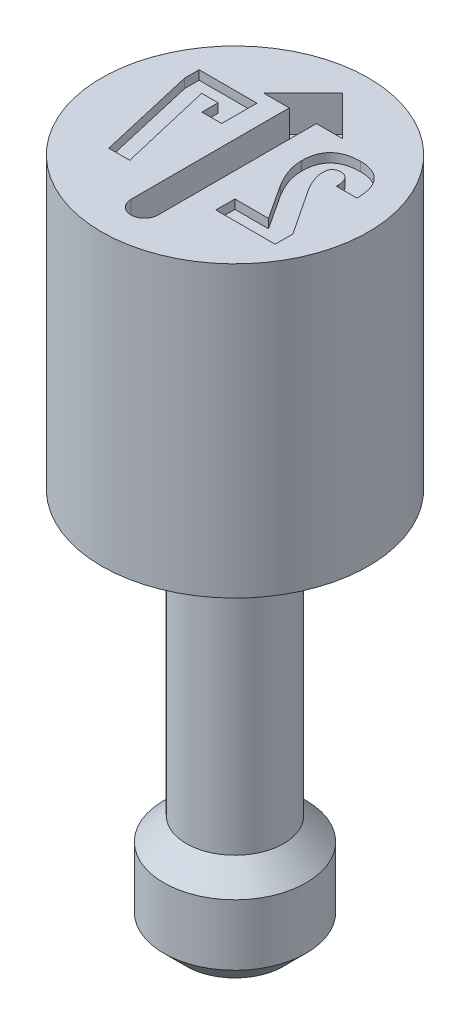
ISO-10303-21;
HEADER;
FILE_DESCRIPTION(('STEP AP214'),'2;1');
FILE_NAME('part.step','',(''),(''),'','','');
FILE_SCHEMA(('AUTOMOTIVE_DESIGN { 1 0 10303 214 1 1 1 1 }'));
ENDSEC;
DATA;
#1=APPLICATION_CONTEXT('core data for automotive mechanical design processes');
#2=APPLICATION_PROTOCOL_DEFINITION('international standard','automotive_design',2000,#1);
#3=PRODUCT_CONTEXT('',#1,'mechanical');
#4=PRODUCT('Part','Part','',(#3));
#5=PRODUCT_RELATED_PRODUCT_CATEGORY('part','',(#4));
#6=PRODUCT_DEFINITION_FORMATION('','',#4);
#7=PRODUCT_DEFINITION_CONTEXT('part definition',#1,'design');
#8=PRODUCT_DEFINITION('design','',#6,#7);
#9=PRODUCT_DEFINITION_SHAPE('','',#8);
#10=(LENGTH_UNIT() NAMED_UNIT(*) SI_UNIT(.MILLI.,.METRE.));
#11=(NAMED_UNIT(*) PLANE_ANGLE_UNIT() SI_UNIT($,.RADIAN.));
#12=(NAMED_UNIT(*) SI_UNIT($,.STERADIAN.) SOLID_ANGLE_UNIT());
#13=UNCERTAINTY_MEASURE_WITH_UNIT(LENGTH_MEASURE(1.E-05),#10,'distance_accuracy_value','');
#14=(GEOMETRIC_REPRESENTATION_CONTEXT(3) GLOBAL_UNCERTAINTY_ASSIGNED_CONTEXT((#13)) GLOBAL_UNIT_ASSIGNED_CONTEXT((#10,
#11,#12)) REPRESENTATION_CONTEXT('',''));
#15=CARTESIAN_POINT('',(0.,0.,0.));
#16=DIRECTION('',(0.,0.,1.));
#17=DIRECTION('',(1.,0.,0.));
#18=AXIS2_PLACEMENT_3D('',#15,#16,#17);
#19=CARTESIAN_POINT('',(0.,7.62,0.));
#20=DIRECTION('',(0.,1.,0.));
#21=DIRECTION('',(0.,0.,1.));
#22=AXIS2_PLACEMENT_3D('',#19,#20,#21);
#23=PLANE('',#22);
#24=DIRECTION('',(1.,0.,0.));
#25=VECTOR('',#24,1.);
#26=CARTESIAN_POINT('',(0.42767656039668,7.62,0.643446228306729));
#27=LINE('',#26,#25);
#28=CARTESIAN_POINT('',(0.42767656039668,7.62,0.643446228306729));
#29=VERTEX_POINT('',#28);
#30=CARTESIAN_POINT('',(1.09385959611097,7.62,0.643446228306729));
#31=VERTEX_POINT('',#30);
#32=EDGE_CURVE('E51',#29,#31,#27,.T.);
#33=ORIENTED_EDGE('',*,*,#32,.F.);
#34=DIRECTION('',(0.,0.,1.));
#35=VECTOR('',#34,1.);
#36=CARTESIAN_POINT('',(0.42767656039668,7.62,0.429030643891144));
#37=LINE('',#36,#35);
#38=CARTESIAN_POINT('',(0.42767656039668,7.62,0.429030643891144));
#39=VERTEX_POINT('',#38);
#40=EDGE_CURVE('E272',#39,#29,#37,.T.);
#41=ORIENTED_EDGE('',*,*,#40,.F.);
#42=DIRECTION('',(-1.,0.,0.));
#43=VECTOR('',#42,1.);
#44=CARTESIAN_POINT('',(0.805223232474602,7.62,0.429030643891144));
#45=LINE('',#44,#43);
#46=CARTESIAN_POINT('',(0.805223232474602,7.62,0.429030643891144));
#47=VERTEX_POINT('',#46);
#48=EDGE_CURVE('E275',#47,#39,#45,.T.);
#49=ORIENTED_EDGE('',*,*,#48,.F.);
#50=DIRECTION('',(0.548079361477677,0.,0.836426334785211));
#51=VECTOR('',#50,1.);
#52=CARTESIAN_POINT('',(0.548543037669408,7.62,0.0373098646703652));
#53=LINE('',#52,#51);
#54=CARTESIAN_POINT('',(0.548543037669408,7.62,0.0373098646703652));
#55=VERTEX_POINT('',#54);
#56=EDGE_CURVE('E587',#55,#47,#53,.T.);
#57=ORIENTED_EDGE('',*,*,#56,.F.);
#58=CARTESIAN_POINT('',(0.430253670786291,7.62,-0.312919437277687));
#59=CARTESIAN_POINT('',(0.430591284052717,7.62,-0.299584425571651));
#60=CARTESIAN_POINT('',(0.431278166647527,7.62,-0.272454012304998));
#61=CARTESIAN_POINT('',(0.437374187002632,7.62,-0.231087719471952));
#62=CARTESIAN_POINT('',(0.446839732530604,7.62,-0.188424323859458));
#63=CARTESIAN_POINT('',(0.460417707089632,7.62,-0.14456094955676));
#64=CARTESIAN_POINT('',(0.477496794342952,7.62,-0.0998966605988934));
#65=CARTESIAN_POINT('',(0.497658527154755,7.62,-0.0543238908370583));
#66=CARTESIAN_POINT('',(0.521280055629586,7.62,-0.00825921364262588));
#67=CARTESIAN_POINT('',(0.539350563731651,7.62,0.021944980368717));
#68=CARTESIAN_POINT('',(0.548543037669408,7.62,0.0373098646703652));
#69=B_SPLINE_CURVE_WITH_KNOTS('',3,(#58,#59,#60,#61,#62,#63,#64,#65,#66,#67,#68),.UNSPECIFIED.,
.F.,.F.,(4,1,1,1,1,1,1,1,4),(0.,0.106874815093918,0.217439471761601,0.334588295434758,
0.457042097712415,0.585227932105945,0.717831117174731,0.856460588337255,1.),.UNSPECIFIED.);
#70=CARTESIAN_POINT('',(0.430253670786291,7.62,-0.312919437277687));
#71=VERTEX_POINT('',#70);
#72=EDGE_CURVE('E590',#71,#55,#69,.T.);
#73=ORIENTED_EDGE('',*,*,#72,.F.);
#74=DIRECTION('',(0.,0.,1.));
#75=VECTOR('',#74,1.);
#76=CARTESIAN_POINT('',(0.430253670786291,7.62,-0.321939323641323));
#77=LINE('',#76,#75);
#78=CARTESIAN_POINT('',(0.430253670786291,7.62,-0.321939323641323));
#79=VERTEX_POINT('',#78);
#80=EDGE_CURVE('E595',#79,#71,#77,.T.);
#81=ORIENTED_EDGE('',*,*,#80,.F.);
#82=CARTESIAN_POINT('',(0.766051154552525,7.62,-0.643047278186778));
#83=CARTESIAN_POINT('',(0.752727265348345,7.62,-0.642812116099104));
#84=CARTESIAN_POINT('',(0.726879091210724,7.62,-0.642355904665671));
#85=CARTESIAN_POINT('',(0.68938007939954,7.62,-0.638495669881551));
#86=CARTESIAN_POINT('',(0.654362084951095,7.61999999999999,-0.631928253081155));
#87=CARTESIAN_POINT('',(0.621577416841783,7.62,-0.623536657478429));
#88=CARTESIAN_POINT('',(0.591515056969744,7.62,-0.61163397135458));
#89=CARTESIAN_POINT('',(0.563617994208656,7.62,-0.597929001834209));
#90=CARTESIAN_POINT('',(0.538586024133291,7.62,-0.580893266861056));
#91=CARTESIAN_POINT('',(0.515640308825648,7.62,-0.561854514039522));
#92=CARTESIAN_POINT('',(0.495517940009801,7.62,-0.540011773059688));
#93=CARTESIAN_POINT('',(0.477823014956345,7.62,-0.515969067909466));
#94=CARTESIAN_POINT('',(0.463149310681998,7.62,-0.489392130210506));
#95=CARTESIAN_POINT('',(0.450880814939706,7.62,-0.460598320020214));
#96=CARTESIAN_POINT('',(0.441757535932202,7.62,-0.429243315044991));
#97=CARTESIAN_POINT('',(0.435122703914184,7.62,-0.395612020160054));
#98=CARTESIAN_POINT('',(0.430857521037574,7.62,-0.359588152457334));
#99=CARTESIAN_POINT('',(0.430459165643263,7.62,-0.334751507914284));
#100=CARTESIAN_POINT('',(0.430253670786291,7.62,-0.321939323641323));
#101=B_SPLINE_CURVE_WITH_KNOTS('',3,(#82,#83,#84,#85,#86,#87,#88,#89,#90,#91,#92,#93,#94,#95,
#96,#97,#98,#99,#100),.UNSPECIFIED.,.F.,.F.,(4,1,1,1,1,1,1,1,1,1,1,1,1,1,1,1,4),(0.,
0.0752568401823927,0.145997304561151,0.212623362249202,0.276423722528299,0.336803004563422,
0.394965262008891,0.451628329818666,0.50742447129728,0.563051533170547,0.618959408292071,
0.675661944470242,0.734157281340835,0.79541935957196,0.859754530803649,0.927653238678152,1.),.UNSPECIFIED.);
#102=CARTESIAN_POINT('',(0.766051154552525,7.62,-0.643047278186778));
#103=VERTEX_POINT('',#102);
#104=EDGE_CURVE('E601',#103,#79,#101,.T.);
#105=ORIENTED_EDGE('',*,*,#104,.F.);
#106=CARTESIAN_POINT('',(1.10519888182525,7.62,-0.288436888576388));
#107=CARTESIAN_POINT('',(1.10445686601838,7.62,-0.302456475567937));
#108=CARTESIAN_POINT('',(1.10301342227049,7.62,-0.329728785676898));
#109=CARTESIAN_POINT('',(1.09754101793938,7.62,-0.369271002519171));
#110=CARTESIAN_POINT('',(1.08960037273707,7.62,-0.40634065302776));
#111=CARTESIAN_POINT('',(1.07912374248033,7.62,-0.440756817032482));
#112=CARTESIAN_POINT('',(1.06621557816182,7.62,-0.472707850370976));
#113=CARTESIAN_POINT('',(1.05039137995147,7.62,-0.501791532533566));
#114=CARTESIAN_POINT('',(1.03237279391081,7.62,-0.528713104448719));
#115=CARTESIAN_POINT('',(1.01130422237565,7.62,-0.552640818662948));
#116=CARTESIAN_POINT('',(0.988205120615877,7.62,-0.574172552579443));
#117=CARTESIAN_POINT('',(0.962595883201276,7.62,-0.59248062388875));
#118=CARTESIAN_POINT('',(0.935223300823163,7.62,-0.608494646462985));
#119=CARTESIAN_POINT('',(0.905296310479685,7.62,-0.620898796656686));
#120=CARTESIAN_POINT('',(0.873550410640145,7.62,-0.631176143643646));
#121=CARTESIAN_POINT('',(0.839541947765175,7.62,-0.637835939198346));
#122=CARTESIAN_POINT('',(0.80355010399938,7.62,-0.642522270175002));
#123=CARTESIAN_POINT('',(0.778781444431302,7.62,-0.642869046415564));
#124=CARTESIAN_POINT('',(0.766051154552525,7.62,-0.643047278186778));
#125=B_SPLINE_CURVE_WITH_KNOTS('',3,(#106,#107,#108,#109,#110,#111,#112,#113,#114,#115,#116,
#117,#118,#119,#120,#121,#122,#123,#124),.UNSPECIFIED.,.F.,.F.,(4,1,1,1,1,1,1,1,1,1,1,1,1,1,1,1,
4),(0.,0.0758438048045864,0.147538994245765,0.215467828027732,0.280523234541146,0.3417329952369,
0.401348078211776,0.45916270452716,0.516417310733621,0.573254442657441,0.629435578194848,
0.686212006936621,0.744244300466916,0.804147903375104,0.866242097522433,0.931252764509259,1.),.UNSPECIFIED.);
#126=CARTESIAN_POINT('',(1.10519888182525,7.62,-0.288436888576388));
#127=VERTEX_POINT('',#126);
#128=EDGE_CURVE('E606',#127,#103,#125,.T.);
#129=ORIENTED_EDGE('',*,*,#128,.F.);
#130=DIRECTION('',(0.,0.,-1.));
#131=VECTOR('',#130,1.);
#132=CARTESIAN_POINT('',(1.10519888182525,7.62,-0.264727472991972));
#133=LINE('',#132,#131);
#134=CARTESIAN_POINT('',(1.10519888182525,7.62,-0.264727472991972));
#135=VERTEX_POINT('',#134);
#136=EDGE_CURVE('E614',#135,#127,#133,.T.);
#137=ORIENTED_EDGE('',*,*,#136,.F.);
#138=DIRECTION('',(1.,0.,0.));
#139=VECTOR('',#138,1.);
#140=CARTESIAN_POINT('',(0.873774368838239,7.62,-0.264727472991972));
#141=LINE('',#140,#139);
#142=CARTESIAN_POINT('',(0.873774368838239,7.62,-0.264727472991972));
#143=VERTEX_POINT('',#142);
#144=EDGE_CURVE('E620',#143,#135,#141,.T.);
#145=ORIENTED_EDGE('',*,*,#144,.F.);
#146=DIRECTION('',(0.,0.,1.));
#147=VECTOR('',#146,1.);
#148=CARTESIAN_POINT('',(0.873774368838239,7.62,-0.289467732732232));
#149=LINE('',#148,#147);
#150=CARTESIAN_POINT('',(0.873774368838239,7.62,-0.289467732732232));
#151=VERTEX_POINT('',#150);
#152=EDGE_CURVE('E623',#151,#143,#149,.T.);
#153=ORIENTED_EDGE('',*,*,#152,.F.);
#154=CARTESIAN_POINT('',(0.76244320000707,7.62,-0.428631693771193));
#155=CARTESIAN_POINT('',(0.77049754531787,7.62,-0.428345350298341));
#156=CARTESIAN_POINT('',(0.785892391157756,7.62,-0.427798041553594));
#157=CARTESIAN_POINT('',(0.80742956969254,7.62,-0.420548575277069));
#158=CARTESIAN_POINT('',(0.826583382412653,7.62,-0.409811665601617));
#159=CARTESIAN_POINT('',(0.842197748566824,7.62,-0.393653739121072));
#160=CARTESIAN_POINT('',(0.855078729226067,7.62,-0.373641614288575));
#161=CARTESIAN_POINT('',(0.86432501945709,7.62,-0.349206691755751));
#162=CARTESIAN_POINT('',(0.871141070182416,7.62,-0.320807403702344));
#163=CARTESIAN_POINT('',(0.872861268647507,7.62,-0.300334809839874));
#164=CARTESIAN_POINT('',(0.873774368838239,7.62,-0.289467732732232));
#165=B_SPLINE_CURVE_WITH_KNOTS('',3,(#154,#155,#156,#157,#158,#159,#160,#161,#162,#163,#164),
.UNSPECIFIED.,.F.,.F.,(4,1,1,1,1,1,1,1,4),(0.,0.120292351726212,0.229923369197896,
0.337343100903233,0.446693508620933,0.563227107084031,0.692213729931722,0.836623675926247,1.),.UNSPECIFIED.);
#166=CARTESIAN_POINT('',(0.76244320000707,7.62,-0.428631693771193));
#167=VERTEX_POINT('',#166);
#168=EDGE_CURVE('E626',#167,#151,#165,.T.);
#169=ORIENTED_EDGE('',*,*,#168,.F.);
#170=CARTESIAN_POINT('',(0.662451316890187,7.62,-0.327866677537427));
#171=CARTESIAN_POINT('',(0.662715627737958,7.62,-0.335707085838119));
#172=CARTESIAN_POINT('',(0.663214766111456,7.62,-0.350513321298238));
#173=CARTESIAN_POINT('',(0.667766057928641,7.61999999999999,-0.371312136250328));
#174=CARTESIAN_POINT('',(0.675827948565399,7.62,-0.389014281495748));
#175=CARTESIAN_POINT('',(0.687164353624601,7.62,-0.403661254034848));
#176=CARTESIAN_POINT('',(0.701756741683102,7.62,-0.414940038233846));
#177=CARTESIAN_POINT('',(0.719347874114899,7.62,-0.423051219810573));
#178=CARTESIAN_POINT('',(0.739934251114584,7.62,-0.427929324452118));
#179=CARTESIAN_POINT('',(0.754683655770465,7.62,-0.428389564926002));
#180=CARTESIAN_POINT('',(0.76244320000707,7.62,-0.428631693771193));
#181=B_SPLINE_CURVE_WITH_KNOTS('',3,(#170,#171,#172,#173,#174,#175,#176,#177,#178,#179,#180),
.UNSPECIFIED.,.F.,.F.,(4,1,1,1,1,1,1,1,4),(0.,0.144747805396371,0.273349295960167,
0.39052211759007,0.501330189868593,0.612138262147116,0.727872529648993,0.856835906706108,1.),.UNSPECIFIED.);
#182=CARTESIAN_POINT('',(0.662451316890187,7.62,-0.327866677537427));
#183=VERTEX_POINT('',#182);
#184=EDGE_CURVE('E631',#183,#167,#181,.T.);
#185=ORIENTED_EDGE('',*,*,#184,.F.);
#186=DIRECTION('',(0.,0.,-1.));
#187=VECTOR('',#186,1.);
#188=CARTESIAN_POINT('',(0.662451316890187,7.62,-0.318073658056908));
#189=LINE('',#188,#187);
#190=CARTESIAN_POINT('',(0.662451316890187,7.62,-0.318073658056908));
#191=VERTEX_POINT('',#190);
#192=EDGE_CURVE('E639',#191,#183,#189,.T.);
#193=ORIENTED_EDGE('',*,*,#192,.F.);
#194=CARTESIAN_POINT('',(0.749557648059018,7.62,-0.076340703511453));
#195=CARTESIAN_POINT('',(0.742659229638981,7.62,-0.0879605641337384));
#196=CARTESIAN_POINT('',(0.729227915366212,7.62,-0.110584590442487));
#197=CARTESIAN_POINT('',(0.711563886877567,7.62,-0.144498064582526));
#198=CARTESIAN_POINT('',(0.696358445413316,7.62,-0.177087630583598));
#199=CARTESIAN_POINT('',(0.684334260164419,7.62,-0.20849394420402));
#200=CARTESIAN_POINT('',(0.67473087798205,7.62,-0.238343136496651));
#201=CARTESIAN_POINT('',(0.667660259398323,7.62,-0.266456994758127));
#202=CARTESIAN_POINT('',(0.663232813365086,7.62,-0.292848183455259));
#203=CARTESIAN_POINT('',(0.662704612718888,7.62,-0.309897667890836));
#204=CARTESIAN_POINT('',(0.662451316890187,7.62,-0.318073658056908));
#205=B_SPLINE_CURVE_WITH_KNOTS('',3,(#194,#195,#196,#197,#198,#199,#200,#201,#202,#203,#204),
.UNSPECIFIED.,.F.,.F.,(4,1,1,1,1,1,1,1,4),(0.,0.156015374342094,0.303764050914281,
0.44135707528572,0.571046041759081,0.691824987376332,0.80321632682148,0.905633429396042,1.),.UNSPECIFIED.);
#206=CARTESIAN_POINT('',(0.749557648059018,7.62,-0.076340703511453));
#207=VERTEX_POINT('',#206);
#208=EDGE_CURVE('E645',#207,#191,#205,.T.);
#209=ORIENTED_EDGE('',*,*,#208,.F.);
#210=DIRECTION('',(-0.552217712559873,0.,-0.833699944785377));
#211=VECTOR('',#210,1.);
#212=CARTESIAN_POINT('',(1.09385959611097,7.62,0.443462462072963));
#213=LINE('',#212,#211);
#214=CARTESIAN_POINT('',(1.09385959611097,7.62,0.443462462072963));
#215=VERTEX_POINT('',#214);
#216=EDGE_CURVE('E650',#215,#207,#213,.T.);
#217=ORIENTED_EDGE('',*,*,#216,.F.);
#218=DIRECTION('',(0.,0.,-1.));
#219=VECTOR('',#218,1.);
#220=CARTESIAN_POINT('',(1.09385959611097,7.62,0.643446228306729));
#221=LINE('',#220,#219);
#222=EDGE_CURVE('E656',#31,#215,#221,.T.);
#223=ORIENTED_EDGE('',*,*,#222,.F.);
#224=EDGE_LOOP('',(#33,#41,#49,#57,#73,#81,#105,#129,#137,#145,#153,#169,#185,#193,#209,#217,#223));
#225=FACE_BOUND('',#224,.T.);
#226=DIRECTION('',(-1.,0.,0.));
#227=VECTOR('',#226,1.);
#228=CARTESIAN_POINT('',(-0.380350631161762,7.62,-0.626553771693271));
#229=LINE('',#228,#227);
#230=CARTESIAN_POINT('',(-0.380350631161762,7.62,-0.626553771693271));
#231=VERTEX_POINT('',#230);
#232=CARTESIAN_POINT('',(-1.03004016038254,7.62,-0.626553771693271));
#233=VERTEX_POINT('',#232);
#234=EDGE_CURVE('E59',#231,#233,#229,.T.);
#235=ORIENTED_EDGE('',*,*,#234,.F.);
#236=DIRECTION('',(0.,0.,-1.));
#237=VECTOR('',#236,1.);
#238=CARTESIAN_POINT('',(-0.380350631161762,7.62,-0.230709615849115));
#239=LINE('',#238,#237);
#240=CARTESIAN_POINT('',(-0.380350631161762,7.62,-0.230709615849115));
#241=VERTEX_POINT('',#240);
#242=EDGE_CURVE('E504',#241,#231,#239,.T.);
#243=ORIENTED_EDGE('',*,*,#242,.F.);
#244=DIRECTION('',(1.,0.,0.));
#245=VECTOR('',#244,1.);
#246=CARTESIAN_POINT('',(-0.602239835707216,7.62,-0.230709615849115));
#247=LINE('',#246,#245);
#248=CARTESIAN_POINT('',(-0.602239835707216,7.62,-0.230709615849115));
#249=VERTEX_POINT('',#248);
#250=EDGE_CURVE('E508',#249,#241,#247,.T.);
#251=ORIENTED_EDGE('',*,*,#250,.F.);
#252=DIRECTION('',(0.,0.,1.));
#253=VECTOR('',#252,1.);
#254=CARTESIAN_POINT('',(-0.602239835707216,7.62,-0.412138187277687));
#255=LINE('',#254,#253);
#256=CARTESIAN_POINT('',(-0.602239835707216,7.62,-0.412138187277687));
#257=VERTEX_POINT('',#256);
#258=EDGE_CURVE('E511',#257,#249,#255,.T.);
#259=ORIENTED_EDGE('',*,*,#258,.F.);
#260=DIRECTION('',(1.,0.,0.));
#261=VECTOR('',#260,1.);
#262=CARTESIAN_POINT('',(-0.786503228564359,7.62,-0.412138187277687));
#263=LINE('',#262,#261);
#264=CARTESIAN_POINT('',(-0.786503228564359,7.62,-0.412138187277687));
#265=VERTEX_POINT('',#264);
#266=EDGE_CURVE('E514',#265,#257,#263,.T.);
#267=ORIENTED_EDGE('',*,*,#266,.F.);
#268=DIRECTION('',(-0.228416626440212,0.,-0.973563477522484));
#269=VECTOR('',#268,1.);
#270=CARTESIAN_POINT('',(-0.5388429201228,7.62,0.643446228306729));
#271=LINE('',#270,#269);
#272=CARTESIAN_POINT('',(-0.5388429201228,7.62,0.643446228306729));
#273=VERTEX_POINT('',#272);
#274=EDGE_CURVE('E517',#273,#265,#271,.T.);
#275=ORIENTED_EDGE('',*,*,#274,.F.);
#276=DIRECTION('',(1.,0.,0.));
#277=VECTOR('',#276,1.);
#278=CARTESIAN_POINT('',(-0.77439080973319,7.62,0.643446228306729));
#279=LINE('',#278,#277);
#280=CARTESIAN_POINT('',(-0.77439080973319,7.62,0.643446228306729));
#281=VERTEX_POINT('',#280);
#282=EDGE_CURVE('E520',#281,#273,#279,.T.);
#283=ORIENTED_EDGE('',*,*,#282,.F.);
#284=DIRECTION('',(0.224694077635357,0.,0.974429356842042));
#285=VECTOR('',#284,1.);
#286=CARTESIAN_POINT('',(-1.03004016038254,7.62,-0.465226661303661));
#287=LINE('',#286,#285);
#288=CARTESIAN_POINT('',(-1.03004016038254,7.62,-0.465226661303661));
#289=VERTEX_POINT('',#288);
#290=EDGE_CURVE('E523',#289,#281,#287,.T.);
#291=ORIENTED_EDGE('',*,*,#290,.F.);
#292=DIRECTION('',(0.,0.,1.));
#293=VECTOR('',#292,1.);
#294=CARTESIAN_POINT('',(-1.03004016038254,7.62,-0.626553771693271));
#295=LINE('',#294,#293);
#296=EDGE_CURVE('E526',#233,#289,#295,.T.);
#297=ORIENTED_EDGE('',*,*,#296,.F.);
#298=EDGE_LOOP('',(#235,#243,#251,#259,#267,#275,#283,#291,#297));
#299=FACE_BOUND('',#298,.T.);
#300=CARTESIAN_POINT('',(0.,7.62,1.016));
#301=DIRECTION('',(0.,1.,0.));
#302=DIRECTION('',(0.,0.,1.));
#303=AXIS2_PLACEMENT_3D('',#300,#301,#302);
#304=CIRCLE('',#303,0.1524);
#305=CARTESIAN_POINT('',(-0.1524,7.62,1.016));
#306=VERTEX_POINT('',#305);
#307=CARTESIAN_POINT('',(0.1524,7.62,1.016));
#308=VERTEX_POINT('',#307);
#309=EDGE_CURVE('E463',#306,#308,#304,.T.);
#310=ORIENTED_EDGE('',*,*,#309,.F.);
#311=DIRECTION('',(0.,0.,1.));
#312=VECTOR('',#311,1.);
#313=CARTESIAN_POINT('',(-0.1524,7.62,1.016));
#314=LINE('',#313,#312);
#315=CARTESIAN_POINT('',(-0.1524,7.62,-0.762));
#316=VERTEX_POINT('',#315);
#317=EDGE_CURVE('E444',#316,#306,#314,.T.);
#318=ORIENTED_EDGE('',*,*,#317,.F.);
#319=DIRECTION('',(1.,0.,0.));
#320=VECTOR('',#319,1.);
#321=CARTESIAN_POINT('',(-0.1524,7.62,-0.762));
#322=LINE('',#321,#320);
#323=CARTESIAN_POINT('',(-0.4445,7.62,-0.762));
#324=VERTEX_POINT('',#323);
#325=EDGE_CURVE('E448',#324,#316,#322,.T.);
#326=ORIENTED_EDGE('',*,*,#325,.F.);
#327=DIRECTION('',(-0.707106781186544,0.,0.707106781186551));
#328=VECTOR('',#327,1.);
#329=CARTESIAN_POINT('',(0.,7.62,-1.2065));
#330=LINE('',#329,#328);
#331=CARTESIAN_POINT('',(0.,7.62,-1.2065));
#332=VERTEX_POINT('',#331);
#333=EDGE_CURVE('E451',#332,#324,#330,.T.);
#334=ORIENTED_EDGE('',*,*,#333,.F.);
#335=DIRECTION('',(-0.707106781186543,0.,-0.707106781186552));
#336=VECTOR('',#335,1.);
#337=CARTESIAN_POINT('',(0.4445,7.62,-0.761999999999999));
#338=LINE('',#337,#336);
#339=CARTESIAN_POINT('',(0.4445,7.62,-0.761999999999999));
#340=VERTEX_POINT('',#339);
#341=EDGE_CURVE('E454',#340,#332,#338,.T.);
#342=ORIENTED_EDGE('',*,*,#341,.F.);
#343=DIRECTION('',(1.,0.,0.));
#344=VECTOR('',#343,1.);
#345=CARTESIAN_POINT('',(0.1524,7.62,-0.762));
#346=LINE('',#345,#344);
#347=CARTESIAN_POINT('',(0.1524,7.62,-0.762));
#348=VERTEX_POINT('',#347);
#349=EDGE_CURVE('E457',#348,#340,#346,.T.);
#350=ORIENTED_EDGE('',*,*,#349,.F.);
#351=DIRECTION('',(0.,0.,-1.));
#352=VECTOR('',#351,1.);
#353=CARTESIAN_POINT('',(0.1524,7.62,1.016));
#354=LINE('',#353,#352);
#355=EDGE_CURVE('E460',#308,#348,#354,.T.);
#356=ORIENTED_EDGE('',*,*,#355,.F.);
#357=EDGE_LOOP('',(#310,#318,#326,#334,#342,#350,#356));
#358=FACE_BOUND('',#357,.T.);
#359=CARTESIAN_POINT('',(0.,7.62,0.));
#360=DIRECTION('',(0.,-1.,0.));
#361=DIRECTION('',(0.,0.,-1.));
#362=AXIS2_PLACEMENT_3D('',#359,#360,#361);
#363=CIRCLE('',#362,1.4986);
#364=CARTESIAN_POINT('',(0.,7.62,-1.4986));
#365=VERTEX_POINT('',#364);
#366=EDGE_CURVE('E11',#365,#365,#363,.T.);
#367=ORIENTED_EDGE('',*,*,#366,.F.);
#368=EDGE_LOOP('',(#367));
#369=FACE_BOUND('',#368,.T.);
#370=ADVANCED_FACE('F37',(#225,#299,#358,#369),#23,.T.);
#371=CARTESIAN_POINT('',(0.,0.,0.));
#372=DIRECTION('',(0.,-1.,0.));
#373=DIRECTION('',(0.,0.,-1.));
#374=AXIS2_PLACEMENT_3D('',#371,#372,#373);
#375=CYLINDRICAL_SURFACE('',#374,1.4986);
#376=ORIENTED_EDGE('',*,*,#366,.T.);
#377=EDGE_LOOP('',(#376));
#378=FACE_BOUND('',#377,.T.);
#379=CARTESIAN_POINT('',(0.,4.3688,0.));
#380=DIRECTION('',(0.,-1.,0.));
#381=DIRECTION('',(0.,0.,-1.));
#382=AXIS2_PLACEMENT_3D('',#379,#380,#381);
#383=CIRCLE('',#382,1.4986);
#384=CARTESIAN_POINT('',(0.,4.3688,-1.4986));
#385=VERTEX_POINT('',#384);
#386=EDGE_CURVE('E44',#385,#385,#383,.T.);
#387=ORIENTED_EDGE('',*,*,#386,.F.);
#388=EDGE_LOOP('',(#387));
#389=FACE_BOUND('',#388,.T.);
#390=ADVANCED_FACE('F400',(#378,#389),#375,.T.);
#391=CARTESIAN_POINT('',(1.4986,4.3688,0.));
#392=DIRECTION('',(0.,-1.,0.));
#393=DIRECTION('',(0.,0.,-1.));
#394=AXIS2_PLACEMENT_3D('',#391,#392,#393);
#395=PLANE('',#394);
#396=ORIENTED_EDGE('',*,*,#386,.T.);
#397=EDGE_LOOP('',(#396));
#398=FACE_BOUND('',#397,.T.);
#399=CARTESIAN_POINT('',(0.,4.3688,0.));
#400=DIRECTION('',(0.,-1.,0.));
#401=DIRECTION('',(0.,0.,-1.));
#402=AXIS2_PLACEMENT_3D('',#399,#400,#401);
#403=CIRCLE('',#402,0.5461);
#404=CARTESIAN_POINT('',(0.,4.3688,-0.5461));
#405=VERTEX_POINT('',#404);
#406=EDGE_CURVE('E412',#405,#405,#403,.T.);
#407=ORIENTED_EDGE('',*,*,#406,.F.);
#408=EDGE_LOOP('',(#407));
#409=FACE_BOUND('',#408,.T.);
#410=ADVANCED_FACE('F397',(#398,#409),#395,.T.);
#411=CARTESIAN_POINT('',(0.,0.,0.));
#412=DIRECTION('',(0.,-1.,0.));
#413=DIRECTION('',(0.,0.,-1.));
#414=AXIS2_PLACEMENT_3D('',#411,#412,#413);
#415=CYLINDRICAL_SURFACE('',#414,0.5461);
#416=ORIENTED_EDGE('',*,*,#406,.T.);
#417=EDGE_LOOP('',(#416));
#418=FACE_BOUND('',#417,.T.);
#419=CARTESIAN_POINT('',(0.,1.1938,0.));
#420=DIRECTION('',(0.,-1.,0.));
#421=DIRECTION('',(0.,0.,-1.));
#422=AXIS2_PLACEMENT_3D('',#419,#420,#421);
#423=CIRCLE('',#422,0.5461);
#424=CARTESIAN_POINT('',(0.,1.1938,-0.5461));
#425=VERTEX_POINT('',#424);
#426=EDGE_CURVE('E414',#425,#425,#423,.T.);
#427=ORIENTED_EDGE('',*,*,#426,.F.);
#428=EDGE_LOOP('',(#427));
#429=FACE_BOUND('',#428,.T.);
#430=ADVANCED_FACE('F393',(#418,#429),#415,.T.);
#431=CARTESIAN_POINT('',(0.,0.939900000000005,0.));
#432=DIRECTION('',(0.,-1.,0.));
#433=DIRECTION('',(0.,0.,-1.));
#434=AXIS2_PLACEMENT_3D('',#431,#432,#433);
#435=CONICAL_SURFACE('',#434,0.8,0.785398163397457);
#436=ORIENTED_EDGE('',*,*,#426,.T.);
#437=EDGE_LOOP('',(#436));
#438=FACE_BOUND('',#437,.T.);
#439=CARTESIAN_POINT('',(0.,0.939900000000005,0.));
#440=DIRECTION('',(0.,-1.,0.));
#441=DIRECTION('',(0.,0.,-1.));
#442=AXIS2_PLACEMENT_3D('',#439,#440,#441);
#443=CIRCLE('',#442,0.8);
#444=CARTESIAN_POINT('',(0.,0.939900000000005,-0.8));
#445=VERTEX_POINT('',#444);
#446=EDGE_CURVE('E419',#445,#445,#443,.T.);
#447=ORIENTED_EDGE('',*,*,#446,.F.);
#448=EDGE_LOOP('',(#447));
#449=FACE_BOUND('',#448,.T.);
#450=ADVANCED_FACE('F389',(#438,#449),#435,.T.);
#451=CARTESIAN_POINT('',(0.,0.,0.));
#452=DIRECTION('',(0.,-1.,0.));
#453=DIRECTION('',(0.,0.,-1.));
#454=AXIS2_PLACEMENT_3D('',#451,#452,#453);
#455=CYLINDRICAL_SURFACE('',#454,0.8);
#456=ORIENTED_EDGE('',*,*,#446,.T.);
#457=EDGE_LOOP('',(#456));
#458=FACE_BOUND('',#457,.T.);
#459=CARTESIAN_POINT('',(0.,0.254,0.));
#460=DIRECTION('',(0.,-1.,0.));
#461=DIRECTION('',(0.,0.,-1.));
#462=AXIS2_PLACEMENT_3D('',#459,#460,#461);
#463=CIRCLE('',#462,0.8);
#464=CARTESIAN_POINT('',(0.,0.254,-0.8));
#465=VERTEX_POINT('',#464);
#466=EDGE_CURVE('E422',#465,#465,#463,.T.);
#467=ORIENTED_EDGE('',*,*,#466,.F.);
#468=EDGE_LOOP('',(#467));
#469=FACE_BOUND('',#468,.T.);
#470=ADVANCED_FACE('F385',(#458,#469),#455,.T.);
#471=CARTESIAN_POINT('',(0.,0.,0.));
#472=DIRECTION('',(0.,1.,0.));
#473=DIRECTION('',(0.,0.,1.));
#474=AXIS2_PLACEMENT_3D('',#471,#472,#473);
#475=CONICAL_SURFACE('',#474,0.546000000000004,0.78539816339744);
#476=ORIENTED_EDGE('',*,*,#466,.T.);
#477=EDGE_LOOP('',(#476));
#478=FACE_BOUND('',#477,.T.);
#479=CARTESIAN_POINT('',(0.,0.,0.));
#480=DIRECTION('',(0.,-1.,0.));
#481=DIRECTION('',(0.,0.,-1.));
#482=AXIS2_PLACEMENT_3D('',#479,#480,#481);
#483=CIRCLE('',#482,0.546000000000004);
#484=CARTESIAN_POINT('',(0.,0.,-0.546000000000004));
#485=VERTEX_POINT('',#484);
#486=EDGE_CURVE('E425',#485,#485,#483,.T.);
#487=ORIENTED_EDGE('',*,*,#486,.F.);
#488=EDGE_LOOP('',(#487));
#489=FACE_BOUND('',#488,.T.);
#490=ADVANCED_FACE('F381',(#478,#489),#475,.T.);
#491=CARTESIAN_POINT('',(0.546000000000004,0.,0.));
#492=DIRECTION('',(0.,-1.,0.));
#493=DIRECTION('',(0.,0.,-1.));
#494=AXIS2_PLACEMENT_3D('',#491,#492,#493);
#495=PLANE('',#494);
#496=ORIENTED_EDGE('',*,*,#486,.T.);
#497=EDGE_LOOP('',(#496));
#498=FACE_BOUND('',#497,.T.);
#499=ADVANCED_FACE('F377',(#498),#495,.T.);
#500=CARTESIAN_POINT('',(0.,7.2136,1.016));
#501=DIRECTION('',(0.,1.,0.));
#502=DIRECTION('',(0.,0.,1.));
#503=AXIS2_PLACEMENT_3D('',#500,#501,#502);
#504=CYLINDRICAL_SURFACE('',#503,0.1524);
#505=ORIENTED_EDGE('',*,*,#309,.T.);
#506=DIRECTION('',(0.,1.,0.));
#507=VECTOR('',#506,1.);
#508=CARTESIAN_POINT('',(0.1524,7.2136,1.016));
#509=LINE('',#508,#507);
#510=CARTESIAN_POINT('',(0.1524,7.2136,1.016));
#511=VERTEX_POINT('',#510);
#512=EDGE_CURVE('E429',#511,#308,#509,.T.);
#513=ORIENTED_EDGE('',*,*,#512,.F.);
#514=CARTESIAN_POINT('',(0.,7.2136,1.016));
#515=DIRECTION('',(0.,1.,0.));
#516=DIRECTION('',(0.,0.,1.));
#517=AXIS2_PLACEMENT_3D('',#514,#515,#516);
#518=CIRCLE('',#517,0.1524);
#519=CARTESIAN_POINT('',(-0.1524,7.2136,1.016));
#520=VERTEX_POINT('',#519);
#521=EDGE_CURVE('E447',#520,#511,#518,.T.);
#522=ORIENTED_EDGE('',*,*,#521,.F.);
#523=DIRECTION('',(0.,1.,0.));
#524=VECTOR('',#523,1.);
#525=CARTESIAN_POINT('',(-0.1524,7.2136,1.016));
#526=LINE('',#525,#524);
#527=EDGE_CURVE('E428',#520,#306,#526,.T.);
#528=ORIENTED_EDGE('',*,*,#527,.T.);
#529=EDGE_LOOP('',(#505,#513,#522,#528));
#530=FACE_BOUND('',#529,.T.);
#531=ADVANCED_FACE('F355',(#530),#504,.F.);
#532=CARTESIAN_POINT('',(-0.1524,7.2136,1.016));
#533=DIRECTION('',(-1.,0.,0.));
#534=DIRECTION('',(0.,0.,1.));
#535=AXIS2_PLACEMENT_3D('',#532,#533,#534);
#536=PLANE('',#535);
#537=ORIENTED_EDGE('',*,*,#317,.T.);
#538=ORIENTED_EDGE('',*,*,#527,.F.);
#539=DIRECTION('',(0.,0.,1.));
#540=VECTOR('',#539,1.);
#541=CARTESIAN_POINT('',(-0.1524,7.2136,1.016));
#542=LINE('',#541,#540);
#543=CARTESIAN_POINT('',(-0.1524,7.2136,-0.762));
#544=VERTEX_POINT('',#543);
#545=EDGE_CURVE('E433',#544,#520,#542,.T.);
#546=ORIENTED_EDGE('',*,*,#545,.F.);
#547=DIRECTION('',(0.,1.,0.));
#548=VECTOR('',#547,1.);
#549=CARTESIAN_POINT('',(-0.1524,7.2136,-0.762));
#550=LINE('',#549,#548);
#551=EDGE_CURVE('E441',#544,#316,#550,.T.);
#552=ORIENTED_EDGE('',*,*,#551,.T.);
#553=EDGE_LOOP('',(#537,#538,#546,#552));
#554=FACE_BOUND('',#553,.T.);
#555=ADVANCED_FACE('F351',(#554),#536,.F.);
#556=CARTESIAN_POINT('',(-0.1524,7.2136,-0.762));
#557=DIRECTION('',(0.,0.,1.));
#558=DIRECTION('',(1.,0.,0.));
#559=AXIS2_PLACEMENT_3D('',#556,#557,#558);
#560=PLANE('',#559);
#561=ORIENTED_EDGE('',*,*,#325,.T.);
#562=ORIENTED_EDGE('',*,*,#551,.F.);
#563=DIRECTION('',(1.,0.,0.));
#564=VECTOR('',#563,1.);
#565=CARTESIAN_POINT('',(-0.1524,7.2136,-0.762));
#566=LINE('',#565,#564);
#567=CARTESIAN_POINT('',(-0.4445,7.2136,-0.762));
#568=VERTEX_POINT('',#567);
#569=EDGE_CURVE('E468',#568,#544,#566,.T.);
#570=ORIENTED_EDGE('',*,*,#569,.F.);
#571=DIRECTION('',(0.,1.,0.));
#572=VECTOR('',#571,1.);
#573=CARTESIAN_POINT('',(-0.4445,7.2136,-0.762));
#574=LINE('',#573,#572);
#575=EDGE_CURVE('E439',#568,#324,#574,.T.);
#576=ORIENTED_EDGE('',*,*,#575,.T.);
#577=EDGE_LOOP('',(#561,#562,#570,#576));
#578=FACE_BOUND('',#577,.T.);
#579=ADVANCED_FACE('F354',(#578),#560,.F.);
#580=CARTESIAN_POINT('',(0.,7.2136,-1.2065));
#581=DIRECTION('',(-0.707106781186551,0.,-0.707106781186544));
#582=DIRECTION('',(-0.707106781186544,0.,0.707106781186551));
#583=AXIS2_PLACEMENT_3D('',#580,#581,#582);
#584=PLANE('',#583);
#585=ORIENTED_EDGE('',*,*,#333,.T.);
#586=ORIENTED_EDGE('',*,*,#575,.F.);
#587=DIRECTION('',(-0.707106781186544,0.,0.707106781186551));
#588=VECTOR('',#587,1.);
#589=CARTESIAN_POINT('',(0.,7.2136,-1.2065));
#590=LINE('',#589,#588);
#591=CARTESIAN_POINT('',(0.,7.2136,-1.2065));
#592=VERTEX_POINT('',#591);
#593=EDGE_CURVE('E471',#592,#568,#590,.T.);
#594=ORIENTED_EDGE('',*,*,#593,.F.);
#595=DIRECTION('',(0.,1.,0.));
#596=VECTOR('',#595,1.);
#597=CARTESIAN_POINT('',(0.,7.2136,-1.2065));
#598=LINE('',#597,#596);
#599=EDGE_CURVE('E437',#592,#332,#598,.T.);
#600=ORIENTED_EDGE('',*,*,#599,.T.);
#601=EDGE_LOOP('',(#585,#586,#594,#600));
#602=FACE_BOUND('',#601,.T.);
#603=ADVANCED_FACE('F359',(#602),#584,.F.);
#604=CARTESIAN_POINT('',(0.4445,7.2136,-0.761999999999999));
#605=DIRECTION('',(0.707106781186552,0.,-0.707106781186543));
#606=DIRECTION('',(-0.707106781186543,0.,-0.707106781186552));
#607=AXIS2_PLACEMENT_3D('',#604,#605,#606);
#608=PLANE('',#607);
#609=ORIENTED_EDGE('',*,*,#341,.T.);
#610=ORIENTED_EDGE('',*,*,#599,.F.);
#611=DIRECTION('',(-0.707106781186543,0.,-0.707106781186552));
#612=VECTOR('',#611,1.);
#613=CARTESIAN_POINT('',(0.4445,7.2136,-0.761999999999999));
#614=LINE('',#613,#612);
#615=CARTESIAN_POINT('',(0.4445,7.2136,-0.761999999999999));
#616=VERTEX_POINT('',#615);
#617=EDGE_CURVE('E474',#616,#592,#614,.T.);
#618=ORIENTED_EDGE('',*,*,#617,.F.);
#619=DIRECTION('',(0.,1.,0.));
#620=VECTOR('',#619,1.);
#621=CARTESIAN_POINT('',(0.4445,7.2136,-0.761999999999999));
#622=LINE('',#621,#620);
#623=EDGE_CURVE('E435',#616,#340,#622,.T.);
#624=ORIENTED_EDGE('',*,*,#623,.T.);
#625=EDGE_LOOP('',(#609,#610,#618,#624));
#626=FACE_BOUND('',#625,.T.);
#627=ADVANCED_FACE('F363',(#626),#608,.F.);
#628=CARTESIAN_POINT('',(0.1524,7.2136,-0.762));
#629=DIRECTION('',(0.,0.,1.));
#630=DIRECTION('',(1.,0.,0.));
#631=AXIS2_PLACEMENT_3D('',#628,#629,#630);
#632=PLANE('',#631);
#633=ORIENTED_EDGE('',*,*,#349,.T.);
#634=ORIENTED_EDGE('',*,*,#623,.F.);
#635=DIRECTION('',(1.,0.,0.));
#636=VECTOR('',#635,1.);
#637=CARTESIAN_POINT('',(0.1524,7.2136,-0.762));
#638=LINE('',#637,#636);
#639=CARTESIAN_POINT('',(0.1524,7.2136,-0.762));
#640=VERTEX_POINT('',#639);
#641=EDGE_CURVE('E477',#640,#616,#638,.T.);
#642=ORIENTED_EDGE('',*,*,#641,.F.);
#643=DIRECTION('',(0.,1.,0.));
#644=VECTOR('',#643,1.);
#645=CARTESIAN_POINT('',(0.1524,7.2136,-0.762));
#646=LINE('',#645,#644);
#647=EDGE_CURVE('E432',#640,#348,#646,.T.);
#648=ORIENTED_EDGE('',*,*,#647,.T.);
#649=EDGE_LOOP('',(#633,#634,#642,#648));
#650=FACE_BOUND('',#649,.T.);
#651=ADVANCED_FACE('F367',(#650),#632,.F.);
#652=CARTESIAN_POINT('',(0.1524,7.2136,1.016));
#653=DIRECTION('',(1.,0.,0.));
#654=DIRECTION('',(0.,0.,-1.));
#655=AXIS2_PLACEMENT_3D('',#652,#653,#654);
#656=PLANE('',#655);
#657=ORIENTED_EDGE('',*,*,#355,.T.);
#658=ORIENTED_EDGE('',*,*,#647,.F.);
#659=DIRECTION('',(0.,0.,-1.));
#660=VECTOR('',#659,1.);
#661=CARTESIAN_POINT('',(0.1524,7.2136,1.016));
#662=LINE('',#661,#660);
#663=EDGE_CURVE('E480',#511,#640,#662,.T.);
#664=ORIENTED_EDGE('',*,*,#663,.F.);
#665=ORIENTED_EDGE('',*,*,#512,.T.);
#666=EDGE_LOOP('',(#657,#658,#664,#665));
#667=FACE_BOUND('',#666,.T.);
#668=ADVANCED_FACE('F349',(#667),#656,.F.);
#669=CARTESIAN_POINT('',(0.,7.2136,1.016));
#670=DIRECTION('',(0.,1.,0.));
#671=DIRECTION('',(0.,0.,1.));
#672=AXIS2_PLACEMENT_3D('',#669,#670,#671);
#673=PLANE('',#672);
#674=ORIENTED_EDGE('',*,*,#521,.T.);
#675=ORIENTED_EDGE('',*,*,#663,.T.);
#676=ORIENTED_EDGE('',*,*,#641,.T.);
#677=ORIENTED_EDGE('',*,*,#617,.T.);
#678=ORIENTED_EDGE('',*,*,#593,.T.);
#679=ORIENTED_EDGE('',*,*,#569,.T.);
#680=ORIENTED_EDGE('',*,*,#545,.T.);
#681=EDGE_LOOP('',(#674,#675,#676,#677,#678,#679,#680));
#682=FACE_BOUND('',#681,.T.);
#683=ADVANCED_FACE('F346',(#682),#673,.T.);
#684=CARTESIAN_POINT('',(-0.380350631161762,7.5184,-0.626553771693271));
#685=DIRECTION('',(0.,0.,-1.));
#686=DIRECTION('',(-1.,0.,0.));
#687=AXIS2_PLACEMENT_3D('',#684,#685,#686);
#688=PLANE('',#687);
#689=ORIENTED_EDGE('',*,*,#234,.T.);
#690=DIRECTION('',(0.,1.,0.));
#691=VECTOR('',#690,1.);
#692=CARTESIAN_POINT('',(-1.03004016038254,7.5184,-0.626553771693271));
#693=LINE('',#692,#691);
#694=CARTESIAN_POINT('',(-1.03004016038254,7.5184,-0.626553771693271));
#695=VERTEX_POINT('',#694);
#696=EDGE_CURVE('E485',#695,#233,#693,.T.);
#697=ORIENTED_EDGE('',*,*,#696,.F.);
#698=DIRECTION('',(-1.,0.,0.));
#699=VECTOR('',#698,1.);
#700=CARTESIAN_POINT('',(-0.380350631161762,7.5184,-0.626553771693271));
#701=LINE('',#700,#699);
#702=CARTESIAN_POINT('',(-0.380350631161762,7.5184,-0.626553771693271));
#703=VERTEX_POINT('',#702);
#704=EDGE_CURVE('E507',#703,#695,#701,.T.);
#705=ORIENTED_EDGE('',*,*,#704,.F.);
#706=DIRECTION('',(0.,1.,0.));
#707=VECTOR('',#706,1.);
#708=CARTESIAN_POINT('',(-0.380350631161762,7.5184,-0.626553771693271));
#709=LINE('',#708,#707);
#710=EDGE_CURVE('E502',#703,#231,#709,.T.);
#711=ORIENTED_EDGE('',*,*,#710,.T.);
#712=EDGE_LOOP('',(#689,#697,#705,#711));
#713=FACE_BOUND('',#712,.T.);
#714=ADVANCED_FACE('F316',(#713),#688,.F.);
#715=CARTESIAN_POINT('',(-0.380350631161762,7.5184,-0.230709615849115));
#716=DIRECTION('',(1.,0.,0.));
#717=DIRECTION('',(0.,0.,-1.));
#718=AXIS2_PLACEMENT_3D('',#715,#716,#717);
#719=PLANE('',#718);
#720=ORIENTED_EDGE('',*,*,#242,.T.);
#721=ORIENTED_EDGE('',*,*,#710,.F.);
#722=DIRECTION('',(0.,0.,-1.));
#723=VECTOR('',#722,1.);
#724=CARTESIAN_POINT('',(-0.380350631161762,7.5184,-0.230709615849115));
#725=LINE('',#724,#723);
#726=CARTESIAN_POINT('',(-0.380350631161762,7.5184,-0.230709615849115));
#727=VERTEX_POINT('',#726);
#728=EDGE_CURVE('E488',#727,#703,#725,.T.);
#729=ORIENTED_EDGE('',*,*,#728,.F.);
#730=DIRECTION('',(0.,1.,0.));
#731=VECTOR('',#730,1.);
#732=CARTESIAN_POINT('',(-0.380350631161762,7.5184,-0.230709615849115));
#733=LINE('',#732,#731);
#734=EDGE_CURVE('E500',#727,#241,#733,.T.);
#735=ORIENTED_EDGE('',*,*,#734,.T.);
#736=EDGE_LOOP('',(#720,#721,#729,#735));
#737=FACE_BOUND('',#736,.T.);
#738=ADVANCED_FACE('F312',(#737),#719,.F.);
#739=CARTESIAN_POINT('',(-0.602239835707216,7.5184,-0.230709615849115));
#740=DIRECTION('',(0.,0.,1.));
#741=DIRECTION('',(1.,0.,0.));
#742=AXIS2_PLACEMENT_3D('',#739,#740,#741);
#743=PLANE('',#742);
#744=ORIENTED_EDGE('',*,*,#250,.T.);
#745=ORIENTED_EDGE('',*,*,#734,.F.);
#746=DIRECTION('',(1.,0.,0.));
#747=VECTOR('',#746,1.);
#748=CARTESIAN_POINT('',(-0.602239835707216,7.5184,-0.230709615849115));
#749=LINE('',#748,#747);
#750=CARTESIAN_POINT('',(-0.602239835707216,7.5184,-0.230709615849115));
#751=VERTEX_POINT('',#750);
#752=EDGE_CURVE('E532',#751,#727,#749,.T.);
#753=ORIENTED_EDGE('',*,*,#752,.F.);
#754=DIRECTION('',(0.,1.,0.));
#755=VECTOR('',#754,1.);
#756=CARTESIAN_POINT('',(-0.602239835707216,7.5184,-0.230709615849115));
#757=LINE('',#756,#755);
#758=EDGE_CURVE('E498',#751,#249,#757,.T.);
#759=ORIENTED_EDGE('',*,*,#758,.T.);
#760=EDGE_LOOP('',(#744,#745,#753,#759));
#761=FACE_BOUND('',#760,.T.);
#762=ADVANCED_FACE('F315',(#761),#743,.F.);
#763=CARTESIAN_POINT('',(-0.602239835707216,7.5184,-0.412138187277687));
#764=DIRECTION('',(-1.,0.,0.));
#765=DIRECTION('',(0.,0.,1.));
#766=AXIS2_PLACEMENT_3D('',#763,#764,#765);
#767=PLANE('',#766);
#768=ORIENTED_EDGE('',*,*,#258,.T.);
#769=ORIENTED_EDGE('',*,*,#758,.F.);
#770=DIRECTION('',(0.,0.,1.));
#771=VECTOR('',#770,1.);
#772=CARTESIAN_POINT('',(-0.602239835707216,7.5184,-0.412138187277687));
#773=LINE('',#772,#771);
#774=CARTESIAN_POINT('',(-0.602239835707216,7.5184,-0.412138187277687));
#775=VERTEX_POINT('',#774);
#776=EDGE_CURVE('E535',#775,#751,#773,.T.);
#777=ORIENTED_EDGE('',*,*,#776,.F.);
#778=DIRECTION('',(0.,1.,0.));
#779=VECTOR('',#778,1.);
#780=CARTESIAN_POINT('',(-0.602239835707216,7.5184,-0.412138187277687));
#781=LINE('',#780,#779);
#782=EDGE_CURVE('E496',#775,#257,#781,.T.);
#783=ORIENTED_EDGE('',*,*,#782,.T.);
#784=EDGE_LOOP('',(#768,#769,#777,#783));
#785=FACE_BOUND('',#784,.T.);
#786=ADVANCED_FACE('F320',(#785),#767,.F.);
#787=CARTESIAN_POINT('',(-0.786503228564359,7.5184,-0.412138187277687));
#788=DIRECTION('',(0.,0.,1.));
#789=DIRECTION('',(1.,0.,0.));
#790=AXIS2_PLACEMENT_3D('',#787,#788,#789);
#791=PLANE('',#790);
#792=ORIENTED_EDGE('',*,*,#266,.T.);
#793=ORIENTED_EDGE('',*,*,#782,.F.);
#794=DIRECTION('',(1.,0.,0.));
#795=VECTOR('',#794,1.);
#796=CARTESIAN_POINT('',(-0.786503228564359,7.5184,-0.412138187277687));
#797=LINE('',#796,#795);
#798=CARTESIAN_POINT('',(-0.786503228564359,7.5184,-0.412138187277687));
#799=VERTEX_POINT('',#798);
#800=EDGE_CURVE('E538',#799,#775,#797,.T.);
#801=ORIENTED_EDGE('',*,*,#800,.F.);
#802=DIRECTION('',(0.,1.,0.));
#803=VECTOR('',#802,1.);
#804=CARTESIAN_POINT('',(-0.786503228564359,7.5184,-0.412138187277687));
#805=LINE('',#804,#803);
#806=EDGE_CURVE('E494',#799,#265,#805,.T.);
#807=ORIENTED_EDGE('',*,*,#806,.T.);
#808=EDGE_LOOP('',(#792,#793,#801,#807));
#809=FACE_BOUND('',#808,.T.);
#810=ADVANCED_FACE('F324',(#809),#791,.F.);
#811=CARTESIAN_POINT('',(-0.5388429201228,7.5184,0.643446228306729));
#812=DIRECTION('',(0.973563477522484,0.,-0.228416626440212));
#813=DIRECTION('',(-0.228416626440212,0.,-0.973563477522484));
#814=AXIS2_PLACEMENT_3D('',#811,#812,#813);
#815=PLANE('',#814);
#816=ORIENTED_EDGE('',*,*,#274,.T.);
#817=ORIENTED_EDGE('',*,*,#806,.F.);
#818=DIRECTION('',(-0.228416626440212,0.,-0.973563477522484));
#819=VECTOR('',#818,1.);
#820=CARTESIAN_POINT('',(-0.5388429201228,7.5184,0.643446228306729));
#821=LINE('',#820,#819);
#822=CARTESIAN_POINT('',(-0.5388429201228,7.5184,0.643446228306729));
#823=VERTEX_POINT('',#822);
#824=EDGE_CURVE('E541',#823,#799,#821,.T.);
#825=ORIENTED_EDGE('',*,*,#824,.F.);
#826=DIRECTION('',(0.,1.,0.));
#827=VECTOR('',#826,1.);
#828=CARTESIAN_POINT('',(-0.5388429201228,7.5184,0.643446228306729));
#829=LINE('',#828,#827);
#830=EDGE_CURVE('E492',#823,#273,#829,.T.);
#831=ORIENTED_EDGE('',*,*,#830,.T.);
#832=EDGE_LOOP('',(#816,#817,#825,#831));
#833=FACE_BOUND('',#832,.T.);
#834=ADVANCED_FACE('F328',(#833),#815,.F.);
#835=CARTESIAN_POINT('',(-0.77439080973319,7.5184,0.643446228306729));
#836=DIRECTION('',(0.,0.,1.));
#837=DIRECTION('',(1.,0.,0.));
#838=AXIS2_PLACEMENT_3D('',#835,#836,#837);
#839=PLANE('',#838);
#840=ORIENTED_EDGE('',*,*,#282,.T.);
#841=ORIENTED_EDGE('',*,*,#830,.F.);
#842=DIRECTION('',(1.,0.,0.));
#843=VECTOR('',#842,1.);
#844=CARTESIAN_POINT('',(-0.77439080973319,7.5184,0.643446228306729));
#845=LINE('',#844,#843);
#846=CARTESIAN_POINT('',(-0.77439080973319,7.5184,0.643446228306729));
#847=VERTEX_POINT('',#846);
#848=EDGE_CURVE('E544',#847,#823,#845,.T.);
#849=ORIENTED_EDGE('',*,*,#848,.F.);
#850=DIRECTION('',(0.,1.,0.));
#851=VECTOR('',#850,1.);
#852=CARTESIAN_POINT('',(-0.77439080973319,7.5184,0.643446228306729));
#853=LINE('',#852,#851);
#854=EDGE_CURVE('E490',#847,#281,#853,.T.);
#855=ORIENTED_EDGE('',*,*,#854,.T.);
#856=EDGE_LOOP('',(#840,#841,#849,#855));
#857=FACE_BOUND('',#856,.T.);
#858=ADVANCED_FACE('F332',(#857),#839,.F.);
#859=CARTESIAN_POINT('',(-1.03004016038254,7.5184,-0.465226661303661));
#860=DIRECTION('',(-0.974429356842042,0.,0.224694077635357));
#861=DIRECTION('',(0.224694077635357,0.,0.974429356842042));
#862=AXIS2_PLACEMENT_3D('',#859,#860,#861);
#863=PLANE('',#862);
#864=ORIENTED_EDGE('',*,*,#290,.T.);
#865=ORIENTED_EDGE('',*,*,#854,.F.);
#866=DIRECTION('',(0.224694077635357,0.,0.974429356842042));
#867=VECTOR('',#866,1.);
#868=CARTESIAN_POINT('',(-1.03004016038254,7.5184,-0.465226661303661));
#869=LINE('',#868,#867);
#870=CARTESIAN_POINT('',(-1.03004016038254,7.5184,-0.465226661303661));
#871=VERTEX_POINT('',#870);
#872=EDGE_CURVE('E547',#871,#847,#869,.T.);
#873=ORIENTED_EDGE('',*,*,#872,.F.);
#874=DIRECTION('',(0.,1.,0.));
#875=VECTOR('',#874,1.);
#876=CARTESIAN_POINT('',(-1.03004016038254,7.5184,-0.465226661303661));
#877=LINE('',#876,#875);
#878=EDGE_CURVE('E487',#871,#289,#877,.T.);
#879=ORIENTED_EDGE('',*,*,#878,.T.);
#880=EDGE_LOOP('',(#864,#865,#873,#879));
#881=FACE_BOUND('',#880,.T.);
#882=ADVANCED_FACE('F336',(#881),#863,.F.);
#883=CARTESIAN_POINT('',(-1.03004016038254,7.5184,-0.626553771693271));
#884=DIRECTION('',(-1.,0.,0.));
#885=DIRECTION('',(0.,0.,1.));
#886=AXIS2_PLACEMENT_3D('',#883,#884,#885);
#887=PLANE('',#886);
#888=ORIENTED_EDGE('',*,*,#296,.T.);
#889=ORIENTED_EDGE('',*,*,#878,.F.);
#890=DIRECTION('',(0.,0.,1.));
#891=VECTOR('',#890,1.);
#892=CARTESIAN_POINT('',(-1.03004016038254,7.5184,-0.626553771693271));
#893=LINE('',#892,#891);
#894=EDGE_CURVE('E550',#695,#871,#893,.T.);
#895=ORIENTED_EDGE('',*,*,#894,.F.);
#896=ORIENTED_EDGE('',*,*,#696,.T.);
#897=EDGE_LOOP('',(#888,#889,#895,#896));
#898=FACE_BOUND('',#897,.T.);
#899=ADVANCED_FACE('F310',(#898),#887,.F.);
#900=CARTESIAN_POINT('',(0.,7.5184,0.));
#901=DIRECTION('',(0.,1.,0.));
#902=DIRECTION('',(0.,0.,1.));
#903=AXIS2_PLACEMENT_3D('',#900,#901,#902);
#904=PLANE('',#903);
#905=ORIENTED_EDGE('',*,*,#704,.T.);
#906=ORIENTED_EDGE('',*,*,#894,.T.);
#907=ORIENTED_EDGE('',*,*,#872,.T.);
#908=ORIENTED_EDGE('',*,*,#848,.T.);
#909=ORIENTED_EDGE('',*,*,#824,.T.);
#910=ORIENTED_EDGE('',*,*,#800,.T.);
#911=ORIENTED_EDGE('',*,*,#776,.T.);
#912=ORIENTED_EDGE('',*,*,#752,.T.);
#913=ORIENTED_EDGE('',*,*,#728,.T.);
#914=EDGE_LOOP('',(#905,#906,#907,#908,#909,#910,#911,#912,#913));
#915=FACE_BOUND('',#914,.T.);
#916=ADVANCED_FACE('F307',(#915),#904,.T.);
#917=CARTESIAN_POINT('',(0.42767656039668,7.5184,0.643446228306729));
#918=DIRECTION('',(0.,0.,1.));
#919=DIRECTION('',(1.,0.,0.));
#920=AXIS2_PLACEMENT_3D('',#917,#918,#919);
#921=PLANE('',#920);
#922=ORIENTED_EDGE('',*,*,#32,.T.);
#923=DIRECTION('',(0.,1.,0.));
#924=VECTOR('',#923,1.);
#925=CARTESIAN_POINT('',(1.09385959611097,7.5184,0.643446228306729));
#926=LINE('',#925,#924);
#927=CARTESIAN_POINT('',(1.09385959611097,7.5184,0.643446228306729));
#928=VERTEX_POINT('',#927);
#929=EDGE_CURVE('E249',#928,#31,#926,.T.);
#930=ORIENTED_EDGE('',*,*,#929,.F.);
#931=DIRECTION('',(1.,0.,0.));
#932=VECTOR('',#931,1.);
#933=CARTESIAN_POINT('',(0.42767656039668,7.5184,0.643446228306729));
#934=LINE('',#933,#932);
#935=CARTESIAN_POINT('',(0.42767656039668,7.5184,0.643446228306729));
#936=VERTEX_POINT('',#935);
#937=EDGE_CURVE('E253',#936,#928,#934,.T.);
#938=ORIENTED_EDGE('',*,*,#937,.F.);
#939=DIRECTION('',(0.,1.,0.));
#940=VECTOR('',#939,1.);
#941=CARTESIAN_POINT('',(0.42767656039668,7.5184,0.643446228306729));
#942=LINE('',#941,#940);
#943=EDGE_CURVE('E465',#936,#29,#942,.T.);
#944=ORIENTED_EDGE('',*,*,#943,.T.);
#945=EDGE_LOOP('',(#922,#930,#938,#944));
#946=FACE_BOUND('',#945,.T.);
#947=ADVANCED_FACE('F251',(#946),#921,.F.);
#948=CARTESIAN_POINT('',(0.42767656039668,7.5184,0.429030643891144));
#949=DIRECTION('',(-1.,0.,0.));
#950=DIRECTION('',(0.,0.,1.));
#951=AXIS2_PLACEMENT_3D('',#948,#949,#950);
#952=PLANE('',#951);
#953=ORIENTED_EDGE('',*,*,#40,.T.);
#954=ORIENTED_EDGE('',*,*,#943,.F.);
#955=DIRECTION('',(0.,0.,1.));
#956=VECTOR('',#955,1.);
#957=CARTESIAN_POINT('',(0.42767656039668,7.5184,0.429030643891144));
#958=LINE('',#957,#956);
#959=CARTESIAN_POINT('',(0.42767656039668,7.5184,0.429030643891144));
#960=VERTEX_POINT('',#959);
#961=EDGE_CURVE('E259',#960,#936,#958,.T.);
#962=ORIENTED_EDGE('',*,*,#961,.F.);
#963=DIRECTION('',(0.,1.,0.));
#964=VECTOR('',#963,1.);
#965=CARTESIAN_POINT('',(0.42767656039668,7.5184,0.429030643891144));
#966=LINE('',#965,#964);
#967=EDGE_CURVE('E582',#960,#39,#966,.T.);
#968=ORIENTED_EDGE('',*,*,#967,.T.);
#969=EDGE_LOOP('',(#953,#954,#962,#968));
#970=FACE_BOUND('',#969,.T.);
#971=ADVANCED_FACE('F306',(#970),#952,.F.);
#972=CARTESIAN_POINT('',(0.805223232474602,7.5184,0.429030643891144));
#973=DIRECTION('',(0.,0.,-1.));
#974=DIRECTION('',(-1.,0.,0.));
#975=AXIS2_PLACEMENT_3D('',#972,#973,#974);
#976=PLANE('',#975);
#977=ORIENTED_EDGE('',*,*,#48,.T.);
#978=ORIENTED_EDGE('',*,*,#967,.F.);
#979=DIRECTION('',(-1.,0.,0.));
#980=VECTOR('',#979,1.);
#981=CARTESIAN_POINT('',(0.805223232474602,7.5184,0.429030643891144));
#982=LINE('',#981,#980);
#983=CARTESIAN_POINT('',(0.805223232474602,7.5184,0.429030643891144));
#984=VERTEX_POINT('',#983);
#985=EDGE_CURVE('E660',#984,#960,#982,.T.);
#986=ORIENTED_EDGE('',*,*,#985,.F.);
#987=DIRECTION('',(0.,1.,0.));
#988=VECTOR('',#987,1.);
#989=CARTESIAN_POINT('',(0.805223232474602,7.5184,0.429030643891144));
#990=LINE('',#989,#988);
#991=EDGE_CURVE('E580',#984,#47,#990,.T.);
#992=ORIENTED_EDGE('',*,*,#991,.T.);
#993=EDGE_LOOP('',(#977,#978,#986,#992));
#994=FACE_BOUND('',#993,.T.);
#995=ADVANCED_FACE('F768',(#994),#976,.F.);
#996=CARTESIAN_POINT('',(0.548543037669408,7.5184,0.0373098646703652));
#997=DIRECTION('',(-0.836426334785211,0.,0.548079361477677));
#998=DIRECTION('',(0.548079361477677,0.,0.836426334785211));
#999=AXIS2_PLACEMENT_3D('',#996,#997,#998);
#1000=PLANE('',#999);
#1001=ORIENTED_EDGE('',*,*,#56,.T.);
#1002=ORIENTED_EDGE('',*,*,#991,.F.);
#1003=DIRECTION('',(0.548079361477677,0.,0.836426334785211));
#1004=VECTOR('',#1003,1.);
#1005=CARTESIAN_POINT('',(0.548543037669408,7.5184,0.0373098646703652));
#1006=LINE('',#1005,#1004);
#1007=CARTESIAN_POINT('',(0.548543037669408,7.5184,0.0373098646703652));
#1008=VERTEX_POINT('',#1007);
#1009=EDGE_CURVE('E662',#1008,#984,#1006,.T.);
#1010=ORIENTED_EDGE('',*,*,#1009,.F.);
#1011=DIRECTION('',(0.,1.,0.));
#1012=VECTOR('',#1011,1.);
#1013=CARTESIAN_POINT('',(0.548543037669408,7.5184,0.0373098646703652));
#1014=LINE('',#1013,#1012);
#1015=EDGE_CURVE('E578',#1008,#55,#1014,.T.);
#1016=ORIENTED_EDGE('',*,*,#1015,.T.);
#1017=EDGE_LOOP('',(#1001,#1002,#1010,#1016));
#1018=FACE_BOUND('',#1017,.T.);
#1019=ADVANCED_FACE('F682',(#1018),#1000,.F.);
#1020=CARTESIAN_POINT('',(0.430253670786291,7.5184,-0.312919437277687));
#1021=CARTESIAN_POINT('',(0.430591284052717,7.5184,-0.299584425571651));
#1022=CARTESIAN_POINT('',(0.431278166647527,7.5184,-0.272454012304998));
#1023=CARTESIAN_POINT('',(0.437374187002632,7.5184,-0.231087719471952));
#1024=CARTESIAN_POINT('',(0.446839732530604,7.5184,-0.188424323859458));
#1025=CARTESIAN_POINT('',(0.460417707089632,7.5184,-0.14456094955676));
#1026=CARTESIAN_POINT('',(0.477496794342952,7.5184,-0.0998966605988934));
#1027=CARTESIAN_POINT('',(0.497658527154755,7.5184,-0.0543238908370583));
#1028=CARTESIAN_POINT('',(0.521280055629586,7.5184,-0.00825921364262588));
#1029=CARTESIAN_POINT('',(0.539350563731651,7.5184,0.021944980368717));
#1030=CARTESIAN_POINT('',(0.548543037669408,7.5184,0.0373098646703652));
#1031=B_SPLINE_CURVE_WITH_KNOTS('',3,(#1020,#1021,#1022,#1023,#1024,#1025,#1026,#1027,#1028,
#1029,#1030),.UNSPECIFIED.,.F.,.F.,(4,1,1,1,1,1,1,1,4),(0.,0.106874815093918,0.217439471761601,
0.334588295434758,0.457042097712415,0.585227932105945,0.717831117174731,0.856460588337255,1.),.UNSPECIFIED.);
#1032=DIRECTION('',(0.,1.,0.));
#1033=VECTOR('',#1032,1.);
#1034=SURFACE_OF_LINEAR_EXTRUSION('',#1031,#1033);
#1035=ORIENTED_EDGE('',*,*,#72,.T.);
#1036=ORIENTED_EDGE('',*,*,#1015,.F.);
#1037=CARTESIAN_POINT('',(0.430253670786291,7.5184,-0.312919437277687));
#1038=VERTEX_POINT('',#1037);
#1039=EDGE_CURVE('E665',#1038,#1008,#1031,.T.);
#1040=ORIENTED_EDGE('',*,*,#1039,.F.);
#1041=DIRECTION('',(0.,1.,0.));
#1042=VECTOR('',#1041,1.);
#1043=CARTESIAN_POINT('',(0.430253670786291,7.5184,-0.312919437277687));
#1044=LINE('',#1043,#1042);
#1045=EDGE_CURVE('E576',#1038,#71,#1044,.T.);
#1046=ORIENTED_EDGE('',*,*,#1045,.T.);
#1047=EDGE_LOOP('',(#1035,#1036,#1040,#1046));
#1048=FACE_BOUND('',#1047,.T.);
#1049=ADVANCED_FACE('F677',(#1048),#1034,.F.);
#1050=CARTESIAN_POINT('',(0.430253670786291,7.5184,-0.321939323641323));
#1051=DIRECTION('',(-1.,0.,0.));
#1052=DIRECTION('',(0.,0.,1.));
#1053=AXIS2_PLACEMENT_3D('',#1050,#1051,#1052);
#1054=PLANE('',#1053);
#1055=ORIENTED_EDGE('',*,*,#80,.T.);
#1056=ORIENTED_EDGE('',*,*,#1045,.F.);
#1057=DIRECTION('',(0.,0.,1.));
#1058=VECTOR('',#1057,1.);
#1059=CARTESIAN_POINT('',(0.430253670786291,7.5184,-0.321939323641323));
#1060=LINE('',#1059,#1058);
#1061=CARTESIAN_POINT('',(0.430253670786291,7.5184,-0.321939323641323));
#1062=VERTEX_POINT('',#1061);
#1063=EDGE_CURVE('E671',#1062,#1038,#1060,.T.);
#1064=ORIENTED_EDGE('',*,*,#1063,.F.);
#1065=DIRECTION('',(0.,1.,0.));
#1066=VECTOR('',#1065,1.);
#1067=CARTESIAN_POINT('',(0.430253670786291,7.5184,-0.321939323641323));
#1068=LINE('',#1067,#1066);
#1069=EDGE_CURVE('E574',#1062,#79,#1068,.T.);
#1070=ORIENTED_EDGE('',*,*,#1069,.T.);
#1071=EDGE_LOOP('',(#1055,#1056,#1064,#1070));
#1072=FACE_BOUND('',#1071,.T.);
#1073=ADVANCED_FACE('F681',(#1072),#1054,.F.);
#1074=CARTESIAN_POINT('',(0.766051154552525,7.5184,-0.643047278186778));
#1075=CARTESIAN_POINT('',(0.752727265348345,7.5184,-0.642812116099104));
#1076=CARTESIAN_POINT('',(0.726879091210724,7.5184,-0.642355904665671));
#1077=CARTESIAN_POINT('',(0.68938007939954,7.5184,-0.638495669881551));
#1078=CARTESIAN_POINT('',(0.654362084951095,7.51839999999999,-0.631928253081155));
#1079=CARTESIAN_POINT('',(0.621577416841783,7.5184,-0.623536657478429));
#1080=CARTESIAN_POINT('',(0.591515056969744,7.5184,-0.61163397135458));
#1081=CARTESIAN_POINT('',(0.563617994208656,7.5184,-0.597929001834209));
#1082=CARTESIAN_POINT('',(0.538586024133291,7.5184,-0.580893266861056));
#1083=CARTESIAN_POINT('',(0.515640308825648,7.5184,-0.561854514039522));
#1084=CARTESIAN_POINT('',(0.495517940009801,7.5184,-0.540011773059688));
#1085=CARTESIAN_POINT('',(0.477823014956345,7.5184,-0.515969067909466));
#1086=CARTESIAN_POINT('',(0.463149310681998,7.5184,-0.489392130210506));
#1087=CARTESIAN_POINT('',(0.450880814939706,7.5184,-0.460598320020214));
#1088=CARTESIAN_POINT('',(0.441757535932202,7.5184,-0.429243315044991));
#1089=CARTESIAN_POINT('',(0.435122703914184,7.5184,-0.395612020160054));
#1090=CARTESIAN_POINT('',(0.430857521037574,7.5184,-0.359588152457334));
#1091=CARTESIAN_POINT('',(0.430459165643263,7.5184,-0.334751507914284));
#1092=CARTESIAN_POINT('',(0.430253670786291,7.5184,-0.321939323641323));
#1093=B_SPLINE_CURVE_WITH_KNOTS('',3,(#1074,#1075,#1076,#1077,#1078,#1079,#1080,#1081,#1082,
#1083,#1084,#1085,#1086,#1087,#1088,#1089,#1090,#1091,#1092),.UNSPECIFIED.,.F.,.F.,(4,1,1,1,1,1,
1,1,1,1,1,1,1,1,1,1,4),(0.,0.0752568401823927,0.145997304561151,0.212623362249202,
0.276423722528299,0.336803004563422,0.394965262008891,0.451628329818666,0.50742447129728,
0.563051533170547,0.618959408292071,0.675661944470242,0.734157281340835,0.79541935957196,
0.859754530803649,0.927653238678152,1.),.UNSPECIFIED.);
#1094=DIRECTION('',(0.,1.,0.));
#1095=VECTOR('',#1094,1.);
#1096=SURFACE_OF_LINEAR_EXTRUSION('',#1093,#1095);
#1097=ORIENTED_EDGE('',*,*,#104,.T.);
#1098=ORIENTED_EDGE('',*,*,#1069,.F.);
#1099=CARTESIAN_POINT('',(0.766051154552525,7.5184,-0.643047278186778));
#1100=VERTEX_POINT('',#1099);
#1101=EDGE_CURVE('E695',#1100,#1062,#1093,.T.);
#1102=ORIENTED_EDGE('',*,*,#1101,.F.);
#1103=DIRECTION('',(0.,1.,0.));
#1104=VECTOR('',#1103,1.);
#1105=CARTESIAN_POINT('',(0.766051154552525,7.5184,-0.643047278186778));
#1106=LINE('',#1105,#1104);
#1107=EDGE_CURVE('E572',#1100,#103,#1106,.T.);
#1108=ORIENTED_EDGE('',*,*,#1107,.T.);
#1109=EDGE_LOOP('',(#1097,#1098,#1102,#1108));
#1110=FACE_BOUND('',#1109,.T.);
#1111=ADVANCED_FACE('F687',(#1110),#1096,.F.);
#1112=CARTESIAN_POINT('',(1.10519888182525,7.5184,-0.288436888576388));
#1113=CARTESIAN_POINT('',(1.10445686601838,7.5184,-0.302456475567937));
#1114=CARTESIAN_POINT('',(1.10301342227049,7.5184,-0.329728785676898));
#1115=CARTESIAN_POINT('',(1.09754101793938,7.5184,-0.369271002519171));
#1116=CARTESIAN_POINT('',(1.08960037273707,7.5184,-0.40634065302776));
#1117=CARTESIAN_POINT('',(1.07912374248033,7.5184,-0.440756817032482));
#1118=CARTESIAN_POINT('',(1.06621557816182,7.5184,-0.472707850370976));
#1119=CARTESIAN_POINT('',(1.05039137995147,7.5184,-0.501791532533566));
#1120=CARTESIAN_POINT('',(1.03237279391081,7.5184,-0.528713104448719));
#1121=CARTESIAN_POINT('',(1.01130422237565,7.5184,-0.552640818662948));
#1122=CARTESIAN_POINT('',(0.988205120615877,7.5184,-0.574172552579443));
#1123=CARTESIAN_POINT('',(0.962595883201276,7.5184,-0.59248062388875));
#1124=CARTESIAN_POINT('',(0.935223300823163,7.5184,-0.608494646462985));
#1125=CARTESIAN_POINT('',(0.905296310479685,7.5184,-0.620898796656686));
#1126=CARTESIAN_POINT('',(0.873550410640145,7.5184,-0.631176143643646));
#1127=CARTESIAN_POINT('',(0.839541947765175,7.5184,-0.637835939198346));
#1128=CARTESIAN_POINT('',(0.80355010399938,7.5184,-0.642522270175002));
#1129=CARTESIAN_POINT('',(0.778781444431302,7.5184,-0.642869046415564));
#1130=CARTESIAN_POINT('',(0.766051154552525,7.5184,-0.643047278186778));
#1131=B_SPLINE_CURVE_WITH_KNOTS('',3,(#1112,#1113,#1114,#1115,#1116,#1117,#1118,#1119,#1120,
#1121,#1122,#1123,#1124,#1125,#1126,#1127,#1128,#1129,#1130),.UNSPECIFIED.,.F.,.F.,(4,1,1,1,1,1,
1,1,1,1,1,1,1,1,1,1,4),(0.,0.0758438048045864,0.147538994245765,0.215467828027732,
0.280523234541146,0.3417329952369,0.401348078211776,0.45916270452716,0.516417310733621,
0.573254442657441,0.629435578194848,0.686212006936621,0.744244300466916,0.804147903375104,
0.866242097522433,0.931252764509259,1.),.UNSPECIFIED.);
#1132=DIRECTION('',(0.,1.,0.));
#1133=VECTOR('',#1132,1.);
#1134=SURFACE_OF_LINEAR_EXTRUSION('',#1131,#1133);
#1135=ORIENTED_EDGE('',*,*,#128,.T.);
#1136=ORIENTED_EDGE('',*,*,#1107,.F.);
#1137=CARTESIAN_POINT('',(1.10519888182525,7.5184,-0.288436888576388));
#1138=VERTEX_POINT('',#1137);
#1139=EDGE_CURVE('E700',#1138,#1100,#1131,.T.);
#1140=ORIENTED_EDGE('',*,*,#1139,.F.);
#1141=DIRECTION('',(0.,1.,0.));
#1142=VECTOR('',#1141,1.);
#1143=CARTESIAN_POINT('',(1.10519888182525,7.5184,-0.288436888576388));
#1144=LINE('',#1143,#1142);
#1145=EDGE_CURVE('E570',#1138,#127,#1144,.T.);
#1146=ORIENTED_EDGE('',*,*,#1145,.T.);
#1147=EDGE_LOOP('',(#1135,#1136,#1140,#1146));
#1148=FACE_BOUND('',#1147,.T.);
#1149=ADVANCED_FACE('F691',(#1148),#1134,.F.);
#1150=CARTESIAN_POINT('',(1.10519888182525,7.5184,-0.264727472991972));
#1151=DIRECTION('',(1.,0.,0.));
#1152=DIRECTION('',(0.,0.,-1.));
#1153=AXIS2_PLACEMENT_3D('',#1150,#1151,#1152);
#1154=PLANE('',#1153);
#1155=ORIENTED_EDGE('',*,*,#136,.T.);
#1156=ORIENTED_EDGE('',*,*,#1145,.F.);
#1157=DIRECTION('',(0.,0.,-1.));
#1158=VECTOR('',#1157,1.);
#1159=CARTESIAN_POINT('',(1.10519888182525,7.5184,-0.264727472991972));
#1160=LINE('',#1159,#1158);
#1161=CARTESIAN_POINT('',(1.10519888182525,7.5184,-0.264727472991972));
#1162=VERTEX_POINT('',#1161);
#1163=EDGE_CURVE('E709',#1162,#1138,#1160,.T.);
#1164=ORIENTED_EDGE('',*,*,#1163,.F.);
#1165=DIRECTION('',(0.,1.,0.));
#1166=VECTOR('',#1165,1.);
#1167=CARTESIAN_POINT('',(1.10519888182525,7.5184,-0.264727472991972));
#1168=LINE('',#1167,#1166);
#1169=EDGE_CURVE('E568',#1162,#135,#1168,.T.);
#1170=ORIENTED_EDGE('',*,*,#1169,.T.);
#1171=EDGE_LOOP('',(#1155,#1156,#1164,#1170));
#1172=FACE_BOUND('',#1171,.T.);
#1173=ADVANCED_FACE('F784',(#1172),#1154,.F.);
#1174=CARTESIAN_POINT('',(0.873774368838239,7.5184,-0.264727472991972));
#1175=DIRECTION('',(0.,0.,1.));
#1176=DIRECTION('',(1.,0.,0.));
#1177=AXIS2_PLACEMENT_3D('',#1174,#1175,#1176);
#1178=PLANE('',#1177);
#1179=ORIENTED_EDGE('',*,*,#144,.T.);
#1180=ORIENTED_EDGE('',*,*,#1169,.F.);
#1181=DIRECTION('',(1.,0.,0.));
#1182=VECTOR('',#1181,1.);
#1183=CARTESIAN_POINT('',(0.873774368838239,7.5184,-0.264727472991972));
#1184=LINE('',#1183,#1182);
#1185=CARTESIAN_POINT('',(0.873774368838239,7.5184,-0.264727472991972));
#1186=VERTEX_POINT('',#1185);
#1187=EDGE_CURVE('E715',#1186,#1162,#1184,.T.);
#1188=ORIENTED_EDGE('',*,*,#1187,.F.);
#1189=DIRECTION('',(0.,1.,0.));
#1190=VECTOR('',#1189,1.);
#1191=CARTESIAN_POINT('',(0.873774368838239,7.5184,-0.264727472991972));
#1192=LINE('',#1191,#1190);
#1193=EDGE_CURVE('E566',#1186,#143,#1192,.T.);
#1194=ORIENTED_EDGE('',*,*,#1193,.T.);
#1195=EDGE_LOOP('',(#1179,#1180,#1188,#1194));
#1196=FACE_BOUND('',#1195,.T.);
#1197=ADVANCED_FACE('F787',(#1196),#1178,.F.);
#1198=CARTESIAN_POINT('',(0.873774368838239,7.5184,-0.289467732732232));
#1199=DIRECTION('',(-1.,0.,0.));
#1200=DIRECTION('',(0.,0.,1.));
#1201=AXIS2_PLACEMENT_3D('',#1198,#1199,#1200);
#1202=PLANE('',#1201);
#1203=ORIENTED_EDGE('',*,*,#152,.T.);
#1204=ORIENTED_EDGE('',*,*,#1193,.F.);
#1205=DIRECTION('',(0.,0.,1.));
#1206=VECTOR('',#1205,1.);
#1207=CARTESIAN_POINT('',(0.873774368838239,7.5184,-0.289467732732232));
#1208=LINE('',#1207,#1206);
#1209=CARTESIAN_POINT('',(0.873774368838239,7.5184,-0.289467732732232));
#1210=VERTEX_POINT('',#1209);
#1211=EDGE_CURVE('E718',#1210,#1186,#1208,.T.);
#1212=ORIENTED_EDGE('',*,*,#1211,.F.);
#1213=DIRECTION('',(0.,1.,0.));
#1214=VECTOR('',#1213,1.);
#1215=CARTESIAN_POINT('',(0.873774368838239,7.5184,-0.289467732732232));
#1216=LINE('',#1215,#1214);
#1217=EDGE_CURVE('E564',#1210,#151,#1216,.T.);
#1218=ORIENTED_EDGE('',*,*,#1217,.T.);
#1219=EDGE_LOOP('',(#1203,#1204,#1212,#1218));
#1220=FACE_BOUND('',#1219,.T.);
#1221=ADVANCED_FACE('F738',(#1220),#1202,.F.);
#1222=CARTESIAN_POINT('',(0.76244320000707,7.5184,-0.428631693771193));
#1223=CARTESIAN_POINT('',(0.77049754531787,7.5184,-0.428345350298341));
#1224=CARTESIAN_POINT('',(0.785892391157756,7.5184,-0.427798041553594));
#1225=CARTESIAN_POINT('',(0.80742956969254,7.5184,-0.420548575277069));
#1226=CARTESIAN_POINT('',(0.826583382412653,7.5184,-0.409811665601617));
#1227=CARTESIAN_POINT('',(0.842197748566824,7.5184,-0.393653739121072));
#1228=CARTESIAN_POINT('',(0.855078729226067,7.5184,-0.373641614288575));
#1229=CARTESIAN_POINT('',(0.86432501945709,7.5184,-0.349206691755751));
#1230=CARTESIAN_POINT('',(0.871141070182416,7.5184,-0.320807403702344));
#1231=CARTESIAN_POINT('',(0.872861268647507,7.5184,-0.300334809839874));
#1232=CARTESIAN_POINT('',(0.873774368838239,7.5184,-0.289467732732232));
#1233=B_SPLINE_CURVE_WITH_KNOTS('',3,(#1222,#1223,#1224,#1225,#1226,#1227,#1228,#1229,#1230,
#1231,#1232),.UNSPECIFIED.,.F.,.F.,(4,1,1,1,1,1,1,1,4),(0.,0.120292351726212,0.229923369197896,
0.337343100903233,0.446693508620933,0.563227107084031,0.692213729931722,0.836623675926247,1.),.UNSPECIFIED.);
#1234=DIRECTION('',(0.,1.,0.));
#1235=VECTOR('',#1234,1.);
#1236=SURFACE_OF_LINEAR_EXTRUSION('',#1233,#1235);
#1237=ORIENTED_EDGE('',*,*,#168,.T.);
#1238=ORIENTED_EDGE('',*,*,#1217,.F.);
#1239=CARTESIAN_POINT('',(0.76244320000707,7.5184,-0.428631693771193));
#1240=VERTEX_POINT('',#1239);
#1241=EDGE_CURVE('E721',#1240,#1210,#1233,.T.);
#1242=ORIENTED_EDGE('',*,*,#1241,.F.);
#1243=DIRECTION('',(0.,1.,0.));
#1244=VECTOR('',#1243,1.);
#1245=CARTESIAN_POINT('',(0.76244320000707,7.5184,-0.428631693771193));
#1246=LINE('',#1245,#1244);
#1247=EDGE_CURVE('E562',#1240,#167,#1246,.T.);
#1248=ORIENTED_EDGE('',*,*,#1247,.T.);
#1249=EDGE_LOOP('',(#1237,#1238,#1242,#1248));
#1250=FACE_BOUND('',#1249,.T.);
#1251=ADVANCED_FACE('F734',(#1250),#1236,.F.);
#1252=CARTESIAN_POINT('',(0.662451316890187,7.5184,-0.327866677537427));
#1253=CARTESIAN_POINT('',(0.662715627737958,7.5184,-0.335707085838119));
#1254=CARTESIAN_POINT('',(0.663214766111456,7.5184,-0.350513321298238));
#1255=CARTESIAN_POINT('',(0.667766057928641,7.51839999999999,-0.371312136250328));
#1256=CARTESIAN_POINT('',(0.675827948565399,7.5184,-0.389014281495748));
#1257=CARTESIAN_POINT('',(0.687164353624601,7.5184,-0.403661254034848));
#1258=CARTESIAN_POINT('',(0.701756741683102,7.5184,-0.414940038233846));
#1259=CARTESIAN_POINT('',(0.719347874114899,7.5184,-0.423051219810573));
#1260=CARTESIAN_POINT('',(0.739934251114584,7.5184,-0.427929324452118));
#1261=CARTESIAN_POINT('',(0.754683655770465,7.5184,-0.428389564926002));
#1262=CARTESIAN_POINT('',(0.76244320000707,7.5184,-0.428631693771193));
#1263=B_SPLINE_CURVE_WITH_KNOTS('',3,(#1252,#1253,#1254,#1255,#1256,#1257,#1258,#1259,#1260,
#1261,#1262),.UNSPECIFIED.,.F.,.F.,(4,1,1,1,1,1,1,1,4),(0.,0.144747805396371,0.273349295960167,
0.39052211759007,0.501330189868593,0.612138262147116,0.727872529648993,0.856835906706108,1.),.UNSPECIFIED.);
#1264=DIRECTION('',(0.,1.,0.));
#1265=VECTOR('',#1264,1.);
#1266=SURFACE_OF_LINEAR_EXTRUSION('',#1263,#1265);
#1267=ORIENTED_EDGE('',*,*,#184,.T.);
#1268=ORIENTED_EDGE('',*,*,#1247,.F.);
#1269=CARTESIAN_POINT('',(0.662451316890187,7.5184,-0.327866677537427));
#1270=VERTEX_POINT('',#1269);
#1271=EDGE_CURVE('E726',#1270,#1240,#1263,.T.);
#1272=ORIENTED_EDGE('',*,*,#1271,.F.);
#1273=DIRECTION('',(0.,1.,0.));
#1274=VECTOR('',#1273,1.);
#1275=CARTESIAN_POINT('',(0.662451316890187,7.5184,-0.327866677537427));
#1276=LINE('',#1275,#1274);
#1277=EDGE_CURVE('E560',#1270,#183,#1276,.T.);
#1278=ORIENTED_EDGE('',*,*,#1277,.T.);
#1279=EDGE_LOOP('',(#1267,#1268,#1272,#1278));
#1280=FACE_BOUND('',#1279,.T.);
#1281=ADVANCED_FACE('F737',(#1280),#1266,.F.);
#1282=CARTESIAN_POINT('',(0.662451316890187,7.5184,-0.318073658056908));
#1283=DIRECTION('',(1.,0.,0.));
#1284=DIRECTION('',(0.,0.,-1.));
#1285=AXIS2_PLACEMENT_3D('',#1282,#1283,#1284);
#1286=PLANE('',#1285);
#1287=ORIENTED_EDGE('',*,*,#192,.T.);
#1288=ORIENTED_EDGE('',*,*,#1277,.F.);
#1289=DIRECTION('',(0.,0.,-1.));
#1290=VECTOR('',#1289,1.);
#1291=CARTESIAN_POINT('',(0.662451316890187,7.5184,-0.318073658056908));
#1292=LINE('',#1291,#1290);
#1293=CARTESIAN_POINT('',(0.662451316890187,7.5184,-0.318073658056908));
#1294=VERTEX_POINT('',#1293);
#1295=EDGE_CURVE('E285',#1294,#1270,#1292,.T.);
#1296=ORIENTED_EDGE('',*,*,#1295,.F.);
#1297=DIRECTION('',(0.,1.,0.));
#1298=VECTOR('',#1297,1.);
#1299=CARTESIAN_POINT('',(0.662451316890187,7.5184,-0.318073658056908));
#1300=LINE('',#1299,#1298);
#1301=EDGE_CURVE('E558',#1294,#191,#1300,.T.);
#1302=ORIENTED_EDGE('',*,*,#1301,.T.);
#1303=EDGE_LOOP('',(#1287,#1288,#1296,#1302));
#1304=FACE_BOUND('',#1303,.T.);
#1305=ADVANCED_FACE('F296',(#1304),#1286,.F.);
#1306=CARTESIAN_POINT('',(0.749557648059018,7.5184,-0.076340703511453));
#1307=CARTESIAN_POINT('',(0.742659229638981,7.5184,-0.0879605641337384));
#1308=CARTESIAN_POINT('',(0.729227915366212,7.5184,-0.110584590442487));
#1309=CARTESIAN_POINT('',(0.711563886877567,7.5184,-0.144498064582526));
#1310=CARTESIAN_POINT('',(0.696358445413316,7.5184,-0.177087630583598));
#1311=CARTESIAN_POINT('',(0.684334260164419,7.5184,-0.20849394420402));
#1312=CARTESIAN_POINT('',(0.67473087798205,7.5184,-0.238343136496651));
#1313=CARTESIAN_POINT('',(0.667660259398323,7.5184,-0.266456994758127));
#1314=CARTESIAN_POINT('',(0.663232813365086,7.5184,-0.292848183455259));
#1315=CARTESIAN_POINT('',(0.662704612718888,7.5184,-0.309897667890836));
#1316=CARTESIAN_POINT('',(0.662451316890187,7.5184,-0.318073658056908));
#1317=B_SPLINE_CURVE_WITH_KNOTS('',3,(#1306,#1307,#1308,#1309,#1310,#1311,#1312,#1313,#1314,
#1315,#1316),.UNSPECIFIED.,.F.,.F.,(4,1,1,1,1,1,1,1,4),(0.,0.156015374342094,0.303764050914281,
0.44135707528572,0.571046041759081,0.691824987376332,0.80321632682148,0.905633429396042,1.),.UNSPECIFIED.);
#1318=DIRECTION('',(0.,1.,0.));
#1319=VECTOR('',#1318,1.);
#1320=SURFACE_OF_LINEAR_EXTRUSION('',#1317,#1319);
#1321=ORIENTED_EDGE('',*,*,#208,.T.);
#1322=ORIENTED_EDGE('',*,*,#1301,.F.);
#1323=CARTESIAN_POINT('',(0.749557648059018,7.5184,-0.076340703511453));
#1324=VERTEX_POINT('',#1323);
#1325=EDGE_CURVE('E279',#1324,#1294,#1317,.T.);
#1326=ORIENTED_EDGE('',*,*,#1325,.F.);
#1327=DIRECTION('',(0.,1.,0.));
#1328=VECTOR('',#1327,1.);
#1329=CARTESIAN_POINT('',(0.749557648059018,7.5184,-0.076340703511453));
#1330=LINE('',#1329,#1328);
#1331=EDGE_CURVE('E556',#1324,#207,#1330,.T.);
#1332=ORIENTED_EDGE('',*,*,#1331,.T.);
#1333=EDGE_LOOP('',(#1321,#1322,#1326,#1332));
#1334=FACE_BOUND('',#1333,.T.);
#1335=ADVANCED_FACE('F291',(#1334),#1320,.F.);
#1336=CARTESIAN_POINT('',(1.09385959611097,7.5184,0.443462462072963));
#1337=DIRECTION('',(0.833699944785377,0.,-0.552217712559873));
#1338=DIRECTION('',(-0.552217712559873,0.,-0.833699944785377));
#1339=AXIS2_PLACEMENT_3D('',#1336,#1337,#1338);
#1340=PLANE('',#1339);
#1341=ORIENTED_EDGE('',*,*,#216,.T.);
#1342=ORIENTED_EDGE('',*,*,#1331,.F.);
#1343=DIRECTION('',(-0.552217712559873,0.,-0.833699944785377));
#1344=VECTOR('',#1343,1.);
#1345=CARTESIAN_POINT('',(1.09385959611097,7.5184,0.443462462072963));
#1346=LINE('',#1345,#1344);
#1347=CARTESIAN_POINT('',(1.09385959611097,7.5184,0.443462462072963));
#1348=VERTEX_POINT('',#1347);
#1349=EDGE_CURVE('E267',#1348,#1324,#1346,.T.);
#1350=ORIENTED_EDGE('',*,*,#1349,.F.);
#1351=DIRECTION('',(0.,1.,0.));
#1352=VECTOR('',#1351,1.);
#1353=CARTESIAN_POINT('',(1.09385959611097,7.5184,0.443462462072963));
#1354=LINE('',#1353,#1352);
#1355=EDGE_CURVE('E258',#1348,#215,#1354,.T.);
#1356=ORIENTED_EDGE('',*,*,#1355,.T.);
#1357=EDGE_LOOP('',(#1341,#1342,#1350,#1356));
#1358=FACE_BOUND('',#1357,.T.);
#1359=ADVANCED_FACE('F295',(#1358),#1340,.F.);
#1360=CARTESIAN_POINT('',(1.09385959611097,7.5184,0.643446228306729));
#1361=DIRECTION('',(1.,0.,0.));
#1362=DIRECTION('',(0.,0.,-1.));
#1363=AXIS2_PLACEMENT_3D('',#1360,#1361,#1362);
#1364=PLANE('',#1363);
#1365=ORIENTED_EDGE('',*,*,#222,.T.);
#1366=ORIENTED_EDGE('',*,*,#1355,.F.);
#1367=DIRECTION('',(0.,0.,-1.));
#1368=VECTOR('',#1367,1.);
#1369=CARTESIAN_POINT('',(1.09385959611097,7.5184,0.643446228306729));
#1370=LINE('',#1369,#1368);
#1371=EDGE_CURVE('E262',#928,#1348,#1370,.T.);
#1372=ORIENTED_EDGE('',*,*,#1371,.F.);
#1373=ORIENTED_EDGE('',*,*,#929,.T.);
#1374=EDGE_LOOP('',(#1365,#1366,#1372,#1373));
#1375=FACE_BOUND('',#1374,.T.);
#1376=ADVANCED_FACE('F263',(#1375),#1364,.F.);
#1377=CARTESIAN_POINT('',(0.690748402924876,7.5184,-0.192000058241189));
#1378=DIRECTION('',(2.76257751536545E-12,1.,-1.56542788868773E-12));
#1379=DIRECTION('',(-1.,2.76257751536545E-12,0.));
#1380=AXIS2_PLACEMENT_3D('',#1377,#1378,#1379);
#1381=PLANE('',#1380);
#1382=ORIENTED_EDGE('',*,*,#937,.T.);
#1383=ORIENTED_EDGE('',*,*,#1371,.T.);
#1384=ORIENTED_EDGE('',*,*,#1349,.T.);
#1385=ORIENTED_EDGE('',*,*,#1325,.T.);
#1386=ORIENTED_EDGE('',*,*,#1295,.T.);
#1387=ORIENTED_EDGE('',*,*,#1271,.T.);
#1388=ORIENTED_EDGE('',*,*,#1241,.T.);
#1389=ORIENTED_EDGE('',*,*,#1211,.T.);
#1390=ORIENTED_EDGE('',*,*,#1187,.T.);
#1391=ORIENTED_EDGE('',*,*,#1163,.T.);
#1392=ORIENTED_EDGE('',*,*,#1139,.T.);
#1393=ORIENTED_EDGE('',*,*,#1101,.T.);
#1394=ORIENTED_EDGE('',*,*,#1063,.T.);
#1395=ORIENTED_EDGE('',*,*,#1039,.T.);
#1396=ORIENTED_EDGE('',*,*,#1009,.T.);
#1397=ORIENTED_EDGE('',*,*,#985,.T.);
#1398=ORIENTED_EDGE('',*,*,#961,.T.);
#1399=EDGE_LOOP('',(#1382,#1383,#1384,#1385,#1386,#1387,#1388,#1389,#1390,#1391,#1392,#1393,
#1394,#1395,#1396,#1397,#1398));
#1400=FACE_BOUND('',#1399,.T.);
#1401=ADVANCED_FACE('F269',(#1400),#1381,.T.);
#1402=CLOSED_SHELL('',(#370,#390,#410,#430,#450,#470,#490,#499,#531,#555,#579,#603,#627,#651,
#668,#683,#714,#738,#762,#786,#810,#834,#858,#882,#899,#916,#947,#971,#995,#1019,#1049,#1073,
#1111,#1149,#1173,#1197,#1221,#1251,#1281,#1305,#1335,#1359,#1376,#1401));
#1403=MANIFOLD_SOLID_BREP('B2',#1402);
#1404=ADVANCED_BREP_SHAPE_REPRESENTATION('',(#18,#1403),#14);
#1405=SHAPE_DEFINITION_REPRESENTATION(#9,#1404);
ENDSEC;
END-ISO-10303-21;
